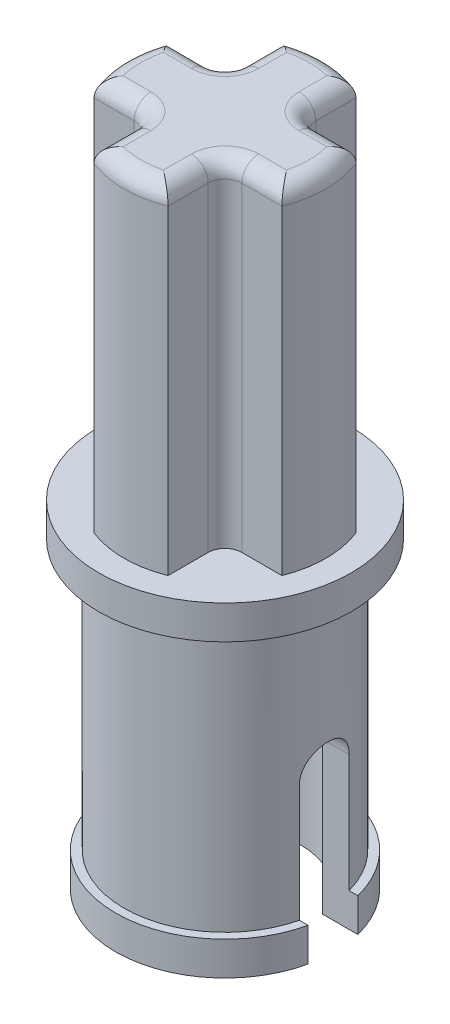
ISO-10303-21;
HEADER;
FILE_DESCRIPTION(('STEP AP214'),'2;1');
FILE_NAME('part.step','',(''),(''),'','','');
FILE_SCHEMA(('AUTOMOTIVE_DESIGN { 1 0 10303 214 1 1 1 1 }'));
ENDSEC;
DATA;
#1=APPLICATION_CONTEXT('core data for automotive mechanical design processes');
#2=APPLICATION_PROTOCOL_DEFINITION('international standard','automotive_design',2000,#1);
#3=PRODUCT_CONTEXT('',#1,'mechanical');
#4=PRODUCT('Part','Part','',(#3));
#5=PRODUCT_RELATED_PRODUCT_CATEGORY('part','',(#4));
#6=PRODUCT_DEFINITION_FORMATION('','',#4);
#7=PRODUCT_DEFINITION_CONTEXT('part definition',#1,'design');
#8=PRODUCT_DEFINITION('design','',#6,#7);
#9=PRODUCT_DEFINITION_SHAPE('','',#8);
#10=(LENGTH_UNIT() NAMED_UNIT(*) SI_UNIT(.MILLI.,.METRE.));
#11=(NAMED_UNIT(*) PLANE_ANGLE_UNIT() SI_UNIT($,.RADIAN.));
#12=(NAMED_UNIT(*) SI_UNIT($,.STERADIAN.) SOLID_ANGLE_UNIT());
#13=UNCERTAINTY_MEASURE_WITH_UNIT(LENGTH_MEASURE(1.E-05),#10,'distance_accuracy_value','');
#14=(GEOMETRIC_REPRESENTATION_CONTEXT(3) GLOBAL_UNCERTAINTY_ASSIGNED_CONTEXT((#13)) GLOBAL_UNIT_ASSIGNED_CONTEXT((#10,
#11,#12)) REPRESENTATION_CONTEXT('',''));
#15=CARTESIAN_POINT('',(0.,0.,0.));
#16=DIRECTION('',(0.,0.,1.));
#17=DIRECTION('',(1.,0.,0.));
#18=AXIS2_PLACEMENT_3D('',#15,#16,#17);
#19=CARTESIAN_POINT('',(0.,8.,0.));
#20=DIRECTION('',(0.,-1.,0.));
#21=DIRECTION('',(0.,0.,-1.));
#22=AXIS2_PLACEMENT_3D('',#19,#20,#21);
#23=CYLINDRICAL_SURFACE('',#22,2.4);
#24=DIRECTION('',(0.,1.,0.));
#25=VECTOR('',#24,1.);
#26=CARTESIAN_POINT('',(0.88,8.,-2.23284571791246));
#27=LINE('',#26,#25);
#28=CARTESIAN_POINT('',(0.88,7.6,-2.23284571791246));
#29=VERTEX_POINT('',#28);
#30=CARTESIAN_POINT('',(0.88,0.,-2.23284571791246));
#31=VERTEX_POINT('',#30);
#32=EDGE_CURVE('E182',#29,#31,#27,.F.);
#33=ORIENTED_EDGE('',*,*,#32,.T.);
#34=CARTESIAN_POINT('',(0.,0.,0.));
#35=DIRECTION('',(0.,-1.,0.));
#36=DIRECTION('',(0.,0.,-1.));
#37=AXIS2_PLACEMENT_3D('',#34,#35,#36);
#38=CIRCLE('',#37,2.4);
#39=CARTESIAN_POINT('',(-0.88,0.,-2.23284571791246));
#40=VERTEX_POINT('',#39);
#41=EDGE_CURVE('E170',#31,#40,#38,.F.);
#42=ORIENTED_EDGE('',*,*,#41,.T.);
#43=DIRECTION('',(0.,1.,0.));
#44=VECTOR('',#43,1.);
#45=CARTESIAN_POINT('',(-0.88,8.,-2.23284571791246));
#46=LINE('',#45,#44);
#47=CARTESIAN_POINT('',(-0.88,7.6,-2.23284571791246));
#48=VERTEX_POINT('',#47);
#49=EDGE_CURVE('E179',#40,#48,#46,.T.);
#50=ORIENTED_EDGE('',*,*,#49,.T.);
#51=CARTESIAN_POINT('',(0.,7.6,0.));
#52=DIRECTION('',(0.,-1.,0.));
#53=DIRECTION('',(0.,0.,-1.));
#54=AXIS2_PLACEMENT_3D('',#51,#52,#53);
#55=CIRCLE('',#54,2.4);
#56=EDGE_CURVE('E185',#48,#29,#55,.T.);
#57=ORIENTED_EDGE('',*,*,#56,.T.);
#58=EDGE_LOOP('',(#33,#42,#50,#57));
#59=FACE_BOUND('',#58,.T.);
#60=ADVANCED_FACE('F16',(#59),#23,.T.);
#61=CARTESIAN_POINT('',(-0.88,8.,-2.23284571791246));
#62=DIRECTION('',(1.,0.,0.));
#63=DIRECTION('',(0.,0.,-1.));
#64=AXIS2_PLACEMENT_3D('',#61,#62,#63);
#65=PLANE('',#64);
#66=DIRECTION('',(0.,0.,-1.));
#67=VECTOR('',#66,1.);
#68=CARTESIAN_POINT('',(-0.88,7.6,0.));
#69=LINE('',#68,#67);
#70=CARTESIAN_POINT('',(-0.88,7.6,-1.28));
#71=VERTEX_POINT('',#70);
#72=EDGE_CURVE('E197',#48,#71,#69,.F.);
#73=ORIENTED_EDGE('',*,*,#72,.F.);
#74=ORIENTED_EDGE('',*,*,#49,.F.);
#75=DIRECTION('',(0.,0.,-1.));
#76=VECTOR('',#75,1.);
#77=CARTESIAN_POINT('',(-0.88,0.,-2.23284571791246));
#78=LINE('',#77,#76);
#79=CARTESIAN_POINT('',(-0.88,0.,-1.28));
#80=VERTEX_POINT('',#79);
#81=EDGE_CURVE('E184',#80,#40,#78,.T.);
#82=ORIENTED_EDGE('',*,*,#81,.F.);
#83=DIRECTION('',(0.,-1.,0.));
#84=VECTOR('',#83,1.);
#85=CARTESIAN_POINT('',(-0.88,8.,-1.28));
#86=LINE('',#85,#84);
#87=EDGE_CURVE('E944',#80,#71,#86,.F.);
#88=ORIENTED_EDGE('',*,*,#87,.T.);
#89=EDGE_LOOP('',(#73,#74,#82,#88));
#90=FACE_BOUND('',#89,.T.);
#91=ADVANCED_FACE('F195',(#90),#65,.F.);
#92=CARTESIAN_POINT('',(0.88,8.,-1.28));
#93=DIRECTION('',(-1.,0.,0.));
#94=DIRECTION('',(0.,0.,1.));
#95=AXIS2_PLACEMENT_3D('',#92,#93,#94);
#96=PLANE('',#95);
#97=DIRECTION('',(0.,0.,1.));
#98=VECTOR('',#97,1.);
#99=CARTESIAN_POINT('',(0.88,7.6,0.));
#100=LINE('',#99,#98);
#101=CARTESIAN_POINT('',(0.88,7.6,-1.28));
#102=VERTEX_POINT('',#101);
#103=EDGE_CURVE('E877',#102,#29,#100,.F.);
#104=ORIENTED_EDGE('',*,*,#103,.F.);
#105=DIRECTION('',(0.,-1.,0.));
#106=VECTOR('',#105,1.);
#107=CARTESIAN_POINT('',(0.88,8.,-1.28));
#108=LINE('',#107,#106);
#109=CARTESIAN_POINT('',(0.88,0.,-1.28));
#110=VERTEX_POINT('',#109);
#111=EDGE_CURVE('E671',#102,#110,#108,.T.);
#112=ORIENTED_EDGE('',*,*,#111,.T.);
#113=DIRECTION('',(0.,0.,1.));
#114=VECTOR('',#113,1.);
#115=CARTESIAN_POINT('',(0.88,0.,-1.28));
#116=LINE('',#115,#114);
#117=EDGE_CURVE('E199',#31,#110,#116,.T.);
#118=ORIENTED_EDGE('',*,*,#117,.F.);
#119=ORIENTED_EDGE('',*,*,#32,.F.);
#120=EDGE_LOOP('',(#104,#112,#118,#119));
#121=FACE_BOUND('',#120,.T.);
#122=ADVANCED_FACE('F1383',(#121),#96,.F.);
#123=CARTESIAN_POINT('',(-1.28,7.6,1.28));
#124=DIRECTION('',(0.,1.,0.));
#125=DIRECTION('',(0.,0.,1.));
#126=AXIS2_PLACEMENT_3D('',#123,#124,#125);
#127=TOROIDAL_SURFACE('',#126,0.8,0.4);
#128=CARTESIAN_POINT('',(-0.48,7.6,1.28));
#129=DIRECTION('',(0.,0.,-1.));
#130=DIRECTION('',(-1.,0.,0.));
#131=AXIS2_PLACEMENT_3D('',#128,#129,#130);
#132=CIRCLE('',#131,0.4);
#133=CARTESIAN_POINT('',(-0.48,8.,1.28));
#134=VERTEX_POINT('',#133);
#135=CARTESIAN_POINT('',(-0.88,7.6,1.28));
#136=VERTEX_POINT('',#135);
#137=EDGE_CURVE('E748',#134,#136,#132,.F.);
#138=ORIENTED_EDGE('',*,*,#137,.F.);
#139=CARTESIAN_POINT('',(-1.28,8.,1.28));
#140=DIRECTION('',(0.,1.,0.));
#141=DIRECTION('',(1.,0.,0.));
#142=AXIS2_PLACEMENT_3D('',#139,#140,#141);
#143=CIRCLE('',#142,0.8);
#144=CARTESIAN_POINT('',(-1.28,8.,0.48));
#145=VERTEX_POINT('',#144);
#146=EDGE_CURVE('E639',#145,#134,#143,.F.);
#147=ORIENTED_EDGE('',*,*,#146,.F.);
#148=CARTESIAN_POINT('',(-1.28,7.6,0.48));
#149=DIRECTION('',(-1.,0.,0.));
#150=DIRECTION('',(0.,0.,1.));
#151=AXIS2_PLACEMENT_3D('',#148,#149,#150);
#152=CIRCLE('',#151,0.4);
#153=CARTESIAN_POINT('',(-1.28,7.6,0.88));
#154=VERTEX_POINT('',#153);
#155=EDGE_CURVE('E723',#154,#145,#152,.T.);
#156=ORIENTED_EDGE('',*,*,#155,.F.);
#157=CARTESIAN_POINT('',(-1.28,7.6,1.28));
#158=DIRECTION('',(0.,-1.,0.));
#159=DIRECTION('',(0.,0.,-1.));
#160=AXIS2_PLACEMENT_3D('',#157,#158,#159);
#161=CIRCLE('',#160,0.4);
#162=EDGE_CURVE('E731',#154,#136,#161,.T.);
#163=ORIENTED_EDGE('',*,*,#162,.T.);
#164=EDGE_LOOP('',(#138,#147,#156,#163));
#165=FACE_BOUND('',#164,.T.);
#166=ADVANCED_FACE('F898',(#165),#127,.T.);
#167=CARTESIAN_POINT('',(1.28,7.6,-1.28));
#168=DIRECTION('',(0.,1.,0.));
#169=DIRECTION('',(0.,0.,1.));
#170=AXIS2_PLACEMENT_3D('',#167,#168,#169);
#171=TOROIDAL_SURFACE('',#170,0.8,0.4);
#172=CARTESIAN_POINT('',(1.28,7.6,-0.48));
#173=DIRECTION('',(1.,0.,0.));
#174=DIRECTION('',(0.,0.,-1.));
#175=AXIS2_PLACEMENT_3D('',#172,#173,#174);
#176=CIRCLE('',#175,0.4);
#177=CARTESIAN_POINT('',(1.28,7.6,-0.88));
#178=VERTEX_POINT('',#177);
#179=CARTESIAN_POINT('',(1.28,8.,-0.48));
#180=VERTEX_POINT('',#179);
#181=EDGE_CURVE('E663',#178,#180,#176,.T.);
#182=ORIENTED_EDGE('',*,*,#181,.F.);
#183=CARTESIAN_POINT('',(1.28,7.6,-1.28));
#184=DIRECTION('',(0.,-1.,0.));
#185=DIRECTION('',(0.,0.,-1.));
#186=AXIS2_PLACEMENT_3D('',#183,#184,#185);
#187=CIRCLE('',#186,0.4);
#188=EDGE_CURVE('E674',#178,#102,#187,.T.);
#189=ORIENTED_EDGE('',*,*,#188,.T.);
#190=CARTESIAN_POINT('',(0.48,7.6,-1.28));
#191=DIRECTION('',(0.,0.,1.));
#192=DIRECTION('',(1.,0.,0.));
#193=AXIS2_PLACEMENT_3D('',#190,#191,#192);
#194=CIRCLE('',#193,0.4);
#195=CARTESIAN_POINT('',(0.48,8.,-1.28));
#196=VERTEX_POINT('',#195);
#197=EDGE_CURVE('E207',#196,#102,#194,.F.);
#198=ORIENTED_EDGE('',*,*,#197,.F.);
#199=CARTESIAN_POINT('',(1.28,8.,-1.28));
#200=DIRECTION('',(0.,1.,0.));
#201=DIRECTION('',(-1.,0.,0.));
#202=AXIS2_PLACEMENT_3D('',#199,#200,#201);
#203=CIRCLE('',#202,0.8);
#204=EDGE_CURVE('E625',#180,#196,#203,.F.);
#205=ORIENTED_EDGE('',*,*,#204,.F.);
#206=EDGE_LOOP('',(#182,#189,#198,#205));
#207=FACE_BOUND('',#206,.T.);
#208=ADVANCED_FACE('F894',(#207),#171,.T.);
#209=CARTESIAN_POINT('',(0.48,7.6,0.));
#210=DIRECTION('',(0.,0.,1.));
#211=DIRECTION('',(1.,0.,0.));
#212=AXIS2_PLACEMENT_3D('',#209,#210,#211);
#213=CYLINDRICAL_SURFACE('',#212,0.4);
#214=CARTESIAN_POINT('',(0.48,8.,-1.94154577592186));
#215=CARTESIAN_POINT('',(0.486567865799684,8.00000003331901,-1.9466844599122));
#216=CARTESIAN_POINT('',(0.493142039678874,7.99983838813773,-1.95181538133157));
#217=CARTESIAN_POINT('',(0.506196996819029,7.99919274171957,-1.9619751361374));
#218=CARTESIAN_POINT('',(0.512677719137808,7.99871355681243,-1.96700435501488));
#219=CARTESIAN_POINT('',(0.525535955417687,7.99744377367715,-1.97695050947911));
#220=CARTESIAN_POINT('',(0.531913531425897,7.99665805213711,-1.98186798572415));
#221=CARTESIAN_POINT('',(0.544555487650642,7.99478673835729,-1.9915815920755));
#222=CARTESIAN_POINT('',(0.55082006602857,7.99370607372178,-1.99637841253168));
#223=CARTESIAN_POINT('',(0.563226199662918,7.99125687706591,-2.00584270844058));
#224=CARTESIAN_POINT('',(0.569368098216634,7.98989331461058,-2.0105110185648));
#225=CARTESIAN_POINT('',(0.581519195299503,7.98689072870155,-2.01971134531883));
#226=CARTESIAN_POINT('',(0.587528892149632,7.98525670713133,-2.02424433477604));
#227=CARTESIAN_POINT('',(0.599406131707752,7.98172593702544,-2.03316808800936));
#228=CARTESIAN_POINT('',(0.605274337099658,7.97983421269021,-2.03755995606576));
#229=CARTESIAN_POINT('',(0.616859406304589,7.97580103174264,-2.04619651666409));
#230=CARTESIAN_POINT('',(0.622577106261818,7.97366461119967,-2.05044243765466));
#231=CARTESIAN_POINT('',(0.63385228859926,7.96915522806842,-2.05878309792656));
#232=CARTESIAN_POINT('',(0.63941078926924,7.96678730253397,-2.06287918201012));
#233=CARTESIAN_POINT('',(0.650359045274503,7.96182823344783,-2.07091706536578));
#234=CARTESIAN_POINT('',(0.655750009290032,7.95924211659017,-2.07486031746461));
#235=CARTESIAN_POINT('',(0.666355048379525,7.95386006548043,-2.08259029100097));
#236=CARTESIAN_POINT('',(0.671570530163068,7.95106913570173,-2.08637856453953));
#237=CARTESIAN_POINT('',(0.681816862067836,7.94529087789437,-2.09379715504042));
#238=CARTESIAN_POINT('',(0.686849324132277,7.94230851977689,-2.0974291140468));
#239=CARTESIAN_POINT('',(0.696722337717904,7.93616080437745,-2.10453439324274));
#240=CARTESIAN_POINT('',(0.701564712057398,7.93300036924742,-2.1080094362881));
#241=CARTESIAN_POINT('',(0.71105060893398,7.92650978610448,-2.11480100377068));
#242=CARTESIAN_POINT('',(0.715696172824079,7.92318449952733,-2.11811932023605));
#243=CARTESIAN_POINT('',(0.724782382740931,7.91637750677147,-2.12459792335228));
#244=CARTESIAN_POINT('',(0.72922528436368,7.91290058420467,-2.12776006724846));
#245=CARTESIAN_POINT('',(0.737899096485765,7.90580298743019,-2.13392852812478));
#246=CARTESIAN_POINT('',(0.742132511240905,7.90218701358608,-2.13693673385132));
#247=CARTESIAN_POINT('',(0.751569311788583,7.89377014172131,-2.14363612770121));
#248=CARTESIAN_POINT('',(0.756736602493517,7.88890679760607,-2.14730002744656));
#249=CARTESIAN_POINT('',(0.766793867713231,7.87891570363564,-2.15441527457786));
#250=CARTESIAN_POINT('',(0.771686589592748,7.87379225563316,-2.15786877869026));
#251=CARTESIAN_POINT('',(0.781182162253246,7.8632960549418,-2.16455803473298));
#252=CARTESIAN_POINT('',(0.785787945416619,7.85792738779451,-2.16779602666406));
#253=CARTESIAN_POINT('',(0.794699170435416,7.84695733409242,-2.17404813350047));
#254=CARTESIAN_POINT('',(0.799007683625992,7.84135976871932,-2.1770645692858));
#255=CARTESIAN_POINT('',(0.807314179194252,7.82994885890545,-2.18286848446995));
#256=CARTESIAN_POINT('',(0.811315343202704,7.82413903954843,-2.18565833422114));
#257=CARTESIAN_POINT('',(0.818997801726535,7.81232107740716,-2.1910045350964));
#258=CARTESIAN_POINT('',(0.822682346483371,7.80631613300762,-2.19356327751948));
#259=CARTESIAN_POINT('',(0.829722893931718,7.79412602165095,-2.19844331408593));
#260=CARTESIAN_POINT('',(0.833082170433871,7.7879436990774,-2.20076698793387));
#261=CARTESIAN_POINT('',(0.83946464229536,7.77541657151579,-2.20517375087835));
#262=CARTESIAN_POINT('',(0.842491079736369,7.76907424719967,-2.20725917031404));
#263=CARTESIAN_POINT('',(0.846783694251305,7.75943011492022,-2.21021186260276));
#264=CARTESIAN_POINT('',(0.848168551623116,7.75620623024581,-2.21116353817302));
#265=CARTESIAN_POINT('',(0.850852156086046,7.74972518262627,-2.21300608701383));
#266=CARTESIAN_POINT('',(0.85215128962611,7.74646825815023,-2.21389723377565));
#267=CARTESIAN_POINT('',(0.854662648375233,7.73992360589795,-2.21561842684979));
#268=CARTESIAN_POINT('',(0.855875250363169,7.73663609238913,-2.21644873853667));
#269=CARTESIAN_POINT('',(0.858212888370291,7.73003259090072,-2.21804805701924));
#270=CARTESIAN_POINT('',(0.859338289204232,7.7267167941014,-2.21881731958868));
#271=CARTESIAN_POINT('',(0.861500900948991,7.72005910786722,-2.22029435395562));
#272=CARTESIAN_POINT('',(0.862538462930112,7.71671738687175,-2.22100237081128));
#273=CARTESIAN_POINT('',(0.86452483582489,7.71001023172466,-2.22235676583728));
#274=CARTESIAN_POINT('',(0.865473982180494,7.70664494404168,-2.22300337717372));
#275=CARTESIAN_POINT('',(0.867283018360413,7.69989304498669,-2.22423484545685));
#276=CARTESIAN_POINT('',(0.868143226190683,7.69650655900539,-2.22481992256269));
#277=CARTESIAN_POINT('',(0.869773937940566,7.68971465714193,-2.22592823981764));
#278=CARTESIAN_POINT('',(0.870544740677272,7.6863093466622,-2.22645168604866));
#279=CARTESIAN_POINT('',(0.871996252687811,7.67948219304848,-2.22743669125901));
#280=CARTESIAN_POINT('',(0.872677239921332,7.67606043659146,-2.22789844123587));
#281=CARTESIAN_POINT('',(0.873948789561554,7.6692027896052,-2.22876003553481));
#282=CARTESIAN_POINT('',(0.874539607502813,7.66576696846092,-2.22916005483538));
#283=CARTESIAN_POINT('',(0.875630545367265,7.65888359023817,-2.22989820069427));
#284=CARTESIAN_POINT('',(0.876130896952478,7.65543608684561,-2.23023648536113));
#285=CARTESIAN_POINT('',(0.87704068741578,7.64853174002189,-2.23085120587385));
#286=CARTESIAN_POINT('',(0.877450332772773,7.64507493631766,-2.23112778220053));
#287=CARTESIAN_POINT('',(0.878178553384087,7.63815438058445,-2.23161915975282));
#288=CARTESIAN_POINT('',(0.87849730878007,7.63469065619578,-2.23183408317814));
#289=CARTESIAN_POINT('',(0.87904365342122,7.62775864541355,-2.23220226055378));
#290=CARTESIAN_POINT('',(0.879271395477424,7.62429037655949,-2.23235561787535));
#291=CARTESIAN_POINT('',(0.879635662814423,7.61735165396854,-2.23260079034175));
#292=CARTESIAN_POINT('',(0.879772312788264,7.61388120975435,-2.2326926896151));
#293=CARTESIAN_POINT('',(0.879954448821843,7.60694051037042,-2.23281513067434));
#294=CARTESIAN_POINT('',(0.880000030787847,7.60347025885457,-2.23284573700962));
#295=CARTESIAN_POINT('',(0.88,7.6,-2.23284571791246));
#296=B_SPLINE_CURVE_WITH_KNOTS('',3,(#214,#215,#216,#217,#218,#219,#220,#221,#222,#223,#224,
#225,#226,#227,#228,#229,#230,#231,#232,#233,#234,#235,#236,#237,#238,#239,#240,#241,#242,#243,
#244,#245,#246,#247,#248,#249,#250,#251,#252,#253,#254,#255,#256,#257,#258,#259,#260,#261,#262,
#263,#264,#265,#266,#267,#268,#269,#270,#271,#272,#273,#274,#275,#276,#277,#278,#279,#280,#281,
#282,#283,#284,#285,#286,#287,#288,#289,#290,#291,#292,#293,#294,#295),.UNSPECIFIED.,.F.,.F.,(4,
2,2,2,2,2,2,2,2,2,2,2,2,2,2,2,2,2,2,2,2,2,2,2,2,2,2,2,2,2,2,2,2,2,2,2,2,2,2,2,4),(0.,
0.0250164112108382,0.0496618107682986,0.0739301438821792,0.097815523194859,0.121312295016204,
0.144415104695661,0.167118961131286,0.189419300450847,0.211312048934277,0.232793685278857,
0.25386130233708,0.27451266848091,0.294746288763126,0.314561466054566,0.333958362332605,
0.3529380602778,0.376884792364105,0.400517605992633,0.423844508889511,0.446875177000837,
0.469620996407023,0.492095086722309,0.51431230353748,0.53628921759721,0.547194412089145,
0.558046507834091,0.568848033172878,0.57960161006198,0.590309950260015,0.600975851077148,
0.611602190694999,0.622191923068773,0.63274807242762,0.643273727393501,0.653772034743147,
0.664246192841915,0.674699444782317,0.685135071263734,0.695556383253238,0.705966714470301),.UNSPECIFIED.);
#297=CARTESIAN_POINT('',(0.48,8.,-1.94154577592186));
#298=VERTEX_POINT('',#297);
#299=EDGE_CURVE('E873',#298,#29,#296,.T.);
#300=ORIENTED_EDGE('',*,*,#299,.F.);
#301=DIRECTION('',(0.,0.,1.));
#302=VECTOR('',#301,1.);
#303=CARTESIAN_POINT('',(0.48,8.,0.));
#304=LINE('',#303,#302);
#305=EDGE_CURVE('E622',#196,#298,#304,.F.);
#306=ORIENTED_EDGE('',*,*,#305,.F.);
#307=ORIENTED_EDGE('',*,*,#197,.T.);
#308=ORIENTED_EDGE('',*,*,#103,.T.);
#309=EDGE_LOOP('',(#300,#306,#307,#308));
#310=FACE_BOUND('',#309,.T.);
#311=ADVANCED_FACE('F838',(#310),#213,.T.);
#312=CARTESIAN_POINT('',(0.,7.6,0.));
#313=DIRECTION('',(0.,1.,0.));
#314=DIRECTION('',(0.,0.,1.));
#315=AXIS2_PLACEMENT_3D('',#312,#313,#314);
#316=TOROIDAL_SURFACE('',#315,2.,0.4);
#317=CARTESIAN_POINT('',(-0.879999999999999,7.6,-2.23284571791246));
#318=CARTESIAN_POINT('',(-0.880000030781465,7.60346963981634,-2.23284573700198));
#319=CARTESIAN_POINT('',(-0.879954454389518,7.60693927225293,-2.23281514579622));
#320=CARTESIAN_POINT('',(-0.879772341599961,7.61387877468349,-2.23269276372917));
#321=CARTESIAN_POINT('',(-0.879635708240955,7.61734864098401,-2.2326009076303));
#322=CARTESIAN_POINT('',(-0.879271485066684,7.62428625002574,-2.23235584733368));
#323=CARTESIAN_POINT('',(-0.879043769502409,7.62775398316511,-2.23220255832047));
#324=CARTESIAN_POINT('',(-0.878497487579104,7.63468496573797,-2.23183454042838));
#325=CARTESIAN_POINT('',(-0.878178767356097,7.63814819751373,-2.23161970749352));
#326=CARTESIAN_POINT('',(-0.877450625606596,7.64506781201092,-2.23112853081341));
#327=CARTESIAN_POINT('',(-0.877041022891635,7.64852416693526,-2.23085206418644));
#328=CARTESIAN_POINT('',(-0.876131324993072,7.65542766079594,-2.23023757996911));
#329=CARTESIAN_POINT('',(-0.875631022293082,7.65887475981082,-2.22989942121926));
#330=CARTESIAN_POINT('',(-0.874540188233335,7.66575737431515,-2.22916154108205));
#331=CARTESIAN_POINT('',(-0.873949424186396,7.66919283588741,-2.22876166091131));
#332=CARTESIAN_POINT('',(-0.872677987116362,7.67604980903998,-2.22790035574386));
#333=CARTESIAN_POINT('',(-0.871997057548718,7.6794712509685,-2.22743875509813));
#334=CARTESIAN_POINT('',(-0.870545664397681,7.68629782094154,-2.22645405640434));
#335=CARTESIAN_POINT('',(-0.869774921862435,7.68970286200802,-2.22593076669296));
#336=CARTESIAN_POINT('',(-0.868144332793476,7.69649427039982,-2.22482276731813));
#337=CARTESIAN_POINT('',(-0.86728418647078,7.69988053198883,-2.22423785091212));
#338=CARTESIAN_POINT('',(-0.865475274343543,7.70663202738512,-2.22300670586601));
#339=CARTESIAN_POINT('',(-0.864526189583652,7.70999713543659,-2.22236025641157));
#340=CARTESIAN_POINT('',(-0.862539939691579,7.71670397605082,-2.22100618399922));
#341=CARTESIAN_POINT('',(-0.861502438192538,7.72004556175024,-2.22029832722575));
#342=CARTESIAN_POINT('',(-0.859339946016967,7.72670302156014,-2.21882160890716));
#343=CARTESIAN_POINT('',(-0.858214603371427,7.73001872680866,-2.21805250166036));
#344=CARTESIAN_POINT('',(-0.855877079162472,7.73662208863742,-2.21645348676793));
#345=CARTESIAN_POINT('',(-0.854664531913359,7.73990955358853,-2.21562332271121));
#346=CARTESIAN_POINT('',(-0.852153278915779,7.74645415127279,-2.21390241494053));
#347=CARTESIAN_POINT('',(-0.850854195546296,7.74971106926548,-2.21301140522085));
#348=CARTESIAN_POINT('',(-0.848170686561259,7.75619214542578,-2.21116911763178));
#349=CARTESIAN_POINT('',(-0.846785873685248,7.75941606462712,-2.21021756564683));
#350=CARTESIAN_POINT('',(-0.842493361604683,7.7690604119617,-2.2072652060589));
#351=CARTESIAN_POINT('',(-0.839466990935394,7.7754029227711,-2.20517998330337));
#352=CARTESIAN_POINT('',(-0.833084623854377,7.78793057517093,-2.20077353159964));
#353=CARTESIAN_POINT('',(-0.829725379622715,7.79411323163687,-2.1984499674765));
#354=CARTESIAN_POINT('',(-0.822684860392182,7.80630414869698,-2.19357004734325));
#355=CARTESIAN_POINT('',(-0.819000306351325,7.81230956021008,-2.19101130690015));
#356=CARTESIAN_POINT('',(-0.811317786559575,7.82412857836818,-2.18566498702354));
#357=CARTESIAN_POINT('',(-0.807316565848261,7.8299389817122,-2.18287501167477));
#358=CARTESIAN_POINT('',(-0.799009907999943,7.84135116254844,-2.17707070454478));
#359=CARTESIAN_POINT('',(-0.794701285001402,7.84694940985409,-2.1740539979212));
#360=CARTESIAN_POINT('',(-0.785789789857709,7.85792091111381,-2.16780118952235));
#361=CARTESIAN_POINT('',(-0.781183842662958,7.86329033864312,-2.16456276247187));
#362=CARTESIAN_POINT('',(-0.77168787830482,7.87378811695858,-2.15787246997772));
#363=CARTESIAN_POINT('',(-0.766794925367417,7.87891237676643,-2.15441836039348));
#364=CARTESIAN_POINT('',(-0.756737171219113,7.88890514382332,-2.14730168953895));
#365=CARTESIAN_POINT('',(-0.751569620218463,7.8937693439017,-2.14363696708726));
#366=CARTESIAN_POINT('',(-0.742134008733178,7.90218609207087,-2.13693730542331));
#367=CARTESIAN_POINT('',(-0.737902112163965,7.9058011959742,-2.13392969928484));
#368=CARTESIAN_POINT('',(-0.729231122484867,7.91289725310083,-2.12776245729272));
#369=CARTESIAN_POINT('',(-0.724789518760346,7.91637349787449,-2.1246009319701));
#370=CARTESIAN_POINT('',(-0.715705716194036,7.92317933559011,-2.11812354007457));
#371=CARTESIAN_POINT('',(-0.711061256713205,7.9265041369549,-2.11480581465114));
#372=CARTESIAN_POINT('',(-0.701577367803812,7.9329939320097,-2.10801539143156));
#373=CARTESIAN_POINT('',(-0.696735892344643,7.9361540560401,-2.10454089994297));
#374=CARTESIAN_POINT('',(-0.686864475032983,7.94230131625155,-2.09743666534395));
#375=CARTESIAN_POINT('',(-0.681832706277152,7.94528352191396,-2.09380519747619));
#376=CARTESIAN_POINT('',(-0.671587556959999,7.95106162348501,-2.08638751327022));
#377=CARTESIAN_POINT('',(-0.666372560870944,7.95385254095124,-2.08259965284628));
#378=CARTESIAN_POINT('',(-0.655768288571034,7.95923469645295,-2.07487041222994));
#379=CARTESIAN_POINT('',(-0.65037760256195,7.96182092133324,-2.07092747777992));
#380=CARTESIAN_POINT('',(-0.63942969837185,7.96678031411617,-2.06289012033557));
#381=CARTESIAN_POINT('',(-0.633871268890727,7.96914844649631,-2.05879424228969));
#382=CARTESIAN_POINT('',(-0.622596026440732,7.97365832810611,-2.05045386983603));
#383=CARTESIAN_POINT('',(-0.616878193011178,7.97579503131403,-2.04620802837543));
#384=CARTESIAN_POINT('',(-0.60529265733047,7.97982883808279,-2.03757148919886));
#385=CARTESIAN_POINT('',(-0.599424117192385,7.98172089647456,-2.0331795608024));
#386=CARTESIAN_POINT('',(-0.587546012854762,7.98525236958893,-2.02425553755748));
#387=CARTESIAN_POINT('',(-0.581535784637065,7.98688675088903,-2.01972233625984));
#388=CARTESIAN_POINT('',(-0.569383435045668,7.98989006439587,-2.01052142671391));
#389=CARTESIAN_POINT('',(-0.563240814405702,7.99125398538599,-2.00585274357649));
#390=CARTESIAN_POINT('',(-0.550833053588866,7.99370387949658,-1.99638753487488));
#391=CARTESIAN_POINT('',(-0.544567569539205,7.99478487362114,-1.99159017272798));
#392=CARTESIAN_POINT('',(-0.531923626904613,7.99665679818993,-1.98187531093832));
#393=CARTESIAN_POINT('',(-0.525544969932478,7.99744279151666,-1.97695711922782));
#394=CARTESIAN_POINT('',(-0.512684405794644,7.99871304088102,-1.96700935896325));
#395=CARTESIAN_POINT('',(-0.506202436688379,7.99919241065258,-1.96197924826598));
#396=CARTESIAN_POINT('',(-0.493144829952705,7.99983831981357,-1.95181753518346));
#397=CARTESIAN_POINT('',(-0.486569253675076,8.00000003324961,-1.9466855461));
#398=CARTESIAN_POINT('',(-0.48,8.,-1.94154577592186));
#399=B_SPLINE_CURVE_WITH_KNOTS('',3,(#317,#318,#319,#320,#321,#322,#323,#324,#325,#326,#327,
#328,#329,#330,#331,#332,#333,#334,#335,#336,#337,#338,#339,#340,#341,#342,#343,#344,#345,#346,
#347,#348,#349,#350,#351,#352,#353,#354,#355,#356,#357,#358,#359,#360,#361,#362,#363,#364,#365,
#366,#367,#368,#369,#370,#371,#372,#373,#374,#375,#376,#377,#378,#379,#380,#381,#382,#383,#384,
#385,#386,#387,#388,#389,#390,#391,#392,#393,#394,#395,#396,#397,#398),.UNSPECIFIED.,.F.,.F.,(4,
2,2,2,2,2,2,2,2,2,2,2,2,2,2,2,2,2,2,2,2,2,2,2,2,2,2,2,2,2,2,2,2,2,2,2,2,2,2,2,4),(0.,
0.0104084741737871,0.0208280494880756,0.0312620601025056,0.0417138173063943,0.0521866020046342,
0.0626836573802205,0.0732081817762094,0.0837633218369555,0.0943521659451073,0.104977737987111,
0.115642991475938,0.126350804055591,0.137103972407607,0.147905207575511,0.158757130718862,
0.169662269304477,0.191639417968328,0.213857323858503,0.236332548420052,0.259079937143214,
0.282112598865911,0.305441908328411,0.329077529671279,0.353027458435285,0.372001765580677,
0.391393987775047,0.411205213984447,0.431435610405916,0.452084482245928,0.473150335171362,
0.494630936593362,0.516523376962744,0.53882413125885,0.561529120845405,0.584633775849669,
0.608133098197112,0.632021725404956,0.656293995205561,0.680944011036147,0.705965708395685),.UNSPECIFIED.);
#400=CARTESIAN_POINT('',(-0.48,8.,-1.94154577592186));
#401=VERTEX_POINT('',#400);
#402=EDGE_CURVE('E818',#401,#48,#399,.F.);
#403=ORIENTED_EDGE('',*,*,#402,.F.);
#404=CARTESIAN_POINT('',(0.,8.,0.));
#405=DIRECTION('',(0.,-1.,0.));
#406=DIRECTION('',(-0.239999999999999,0.,-0.970772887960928));
#407=AXIS2_PLACEMENT_3D('',#404,#405,#406);
#408=CIRCLE('',#407,2.);
#409=EDGE_CURVE('E619',#298,#401,#408,.F.);
#410=ORIENTED_EDGE('',*,*,#409,.F.);
#411=ORIENTED_EDGE('',*,*,#299,.T.);
#412=ORIENTED_EDGE('',*,*,#56,.F.);
#413=EDGE_LOOP('',(#403,#410,#411,#412));
#414=FACE_BOUND('',#413,.T.);
#415=ADVANCED_FACE('F834',(#414),#316,.T.);
#416=CARTESIAN_POINT('',(-0.48,7.6,0.));
#417=DIRECTION('',(0.,0.,-1.));
#418=DIRECTION('',(-1.,0.,0.));
#419=AXIS2_PLACEMENT_3D('',#416,#417,#418);
#420=CYLINDRICAL_SURFACE('',#419,0.4);
#421=CARTESIAN_POINT('',(-0.48,7.6,-1.28000000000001));
#422=DIRECTION('',(0.,0.,-1.));
#423=DIRECTION('',(1.,0.,0.));
#424=AXIS2_PLACEMENT_3D('',#421,#422,#423);
#425=CIRCLE('',#424,0.4);
#426=CARTESIAN_POINT('',(-0.48,8.,-1.28000000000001));
#427=VERTEX_POINT('',#426);
#428=EDGE_CURVE('E780',#427,#71,#425,.F.);
#429=ORIENTED_EDGE('',*,*,#428,.F.);
#430=DIRECTION('',(0.,0.,1.));
#431=VECTOR('',#430,1.);
#432=CARTESIAN_POINT('',(-0.48,8.,0.));
#433=LINE('',#432,#431);
#434=EDGE_CURVE('E616',#401,#427,#433,.T.);
#435=ORIENTED_EDGE('',*,*,#434,.F.);
#436=ORIENTED_EDGE('',*,*,#402,.T.);
#437=ORIENTED_EDGE('',*,*,#72,.T.);
#438=EDGE_LOOP('',(#429,#435,#436,#437));
#439=FACE_BOUND('',#438,.T.);
#440=ADVANCED_FACE('F798',(#439),#420,.T.);
#441=CARTESIAN_POINT('',(-1.28,7.6,-1.28));
#442=DIRECTION('',(0.,1.,0.));
#443=DIRECTION('',(0.,0.,1.));
#444=AXIS2_PLACEMENT_3D('',#441,#442,#443);
#445=TOROIDAL_SURFACE('',#444,0.8,0.4);
#446=CARTESIAN_POINT('',(-1.28,7.6,-0.48));
#447=DIRECTION('',(1.,0.,0.));
#448=DIRECTION('',(0.,0.,-1.));
#449=AXIS2_PLACEMENT_3D('',#446,#447,#448);
#450=CIRCLE('',#449,0.4);
#451=CARTESIAN_POINT('',(-1.28,8.,-0.48));
#452=VERTEX_POINT('',#451);
#453=CARTESIAN_POINT('',(-1.28,7.6,-0.88));
#454=VERTEX_POINT('',#453);
#455=EDGE_CURVE('E694',#452,#454,#450,.F.);
#456=ORIENTED_EDGE('',*,*,#455,.F.);
#457=CARTESIAN_POINT('',(-1.28,8.,-1.28));
#458=DIRECTION('',(0.,1.,0.));
#459=DIRECTION('',(0.,0.,1.));
#460=AXIS2_PLACEMENT_3D('',#457,#458,#459);
#461=CIRCLE('',#460,0.8);
#462=EDGE_CURVE('E613',#427,#452,#461,.F.);
#463=ORIENTED_EDGE('',*,*,#462,.F.);
#464=ORIENTED_EDGE('',*,*,#428,.T.);
#465=CARTESIAN_POINT('',(-1.28,7.6,-1.28));
#466=DIRECTION('',(0.,-1.,0.));
#467=DIRECTION('',(0.,0.,-1.));
#468=AXIS2_PLACEMENT_3D('',#465,#466,#467);
#469=CIRCLE('',#468,0.4);
#470=EDGE_CURVE('E945',#71,#454,#469,.T.);
#471=ORIENTED_EDGE('',*,*,#470,.T.);
#472=EDGE_LOOP('',(#456,#463,#464,#471));
#473=FACE_BOUND('',#472,.T.);
#474=ADVANCED_FACE('F794',(#473),#445,.T.);
#475=CARTESIAN_POINT('',(1.28,7.6,1.28));
#476=DIRECTION('',(0.,1.,0.));
#477=DIRECTION('',(0.,0.,1.));
#478=AXIS2_PLACEMENT_3D('',#475,#476,#477);
#479=TOROIDAL_SURFACE('',#478,0.8,0.4);
#480=CARTESIAN_POINT('',(0.48,7.6,1.28));
#481=DIRECTION('',(0.,0.,1.));
#482=DIRECTION('',(1.,0.,0.));
#483=AXIS2_PLACEMENT_3D('',#480,#481,#482);
#484=CIRCLE('',#483,0.4);
#485=CARTESIAN_POINT('',(0.88,7.6,1.28));
#486=VERTEX_POINT('',#485);
#487=CARTESIAN_POINT('',(0.48,8.,1.28000000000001));
#488=VERTEX_POINT('',#487);
#489=EDGE_CURVE('E772',#486,#488,#484,.T.);
#490=ORIENTED_EDGE('',*,*,#489,.F.);
#491=CARTESIAN_POINT('',(1.28,7.6,1.28));
#492=DIRECTION('',(0.,-1.,0.));
#493=DIRECTION('',(0.,0.,-1.));
#494=AXIS2_PLACEMENT_3D('',#491,#492,#493);
#495=CIRCLE('',#494,0.4);
#496=CARTESIAN_POINT('',(1.28,7.6,0.88));
#497=VERTEX_POINT('',#496);
#498=EDGE_CURVE('E1107',#486,#497,#495,.T.);
#499=ORIENTED_EDGE('',*,*,#498,.T.);
#500=CARTESIAN_POINT('',(1.28,7.6,0.48));
#501=DIRECTION('',(-1.,0.,0.));
#502=DIRECTION('',(0.,0.,1.));
#503=AXIS2_PLACEMENT_3D('',#500,#501,#502);
#504=CIRCLE('',#503,0.4);
#505=CARTESIAN_POINT('',(1.28,8.,0.48));
#506=VERTEX_POINT('',#505);
#507=EDGE_CURVE('E981',#506,#497,#504,.F.);
#508=ORIENTED_EDGE('',*,*,#507,.F.);
#509=CARTESIAN_POINT('',(1.28,8.,1.28));
#510=DIRECTION('',(0.,1.,0.));
#511=DIRECTION('',(0.,0.,-1.));
#512=AXIS2_PLACEMENT_3D('',#509,#510,#511);
#513=CIRCLE('',#512,0.8);
#514=EDGE_CURVE('E631',#488,#506,#513,.F.);
#515=ORIENTED_EDGE('',*,*,#514,.F.);
#516=EDGE_LOOP('',(#490,#499,#508,#515));
#517=FACE_BOUND('',#516,.T.);
#518=ADVANCED_FACE('F763',(#517),#479,.T.);
#519=CARTESIAN_POINT('',(0.480000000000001,7.6,0.));
#520=DIRECTION('',(0.,0.,1.));
#521=DIRECTION('',(1.,0.,0.));
#522=AXIS2_PLACEMENT_3D('',#519,#520,#521);
#523=CYLINDRICAL_SURFACE('',#522,0.4);
#524=CARTESIAN_POINT('',(0.88,7.6,2.23284571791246));
#525=CARTESIAN_POINT('',(0.880000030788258,7.60346982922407,2.23284573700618));
#526=CARTESIAN_POINT('',(0.879954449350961,7.60693965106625,2.23281514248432));
#527=CARTESIAN_POINT('',(0.879772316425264,7.61387953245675,2.23269274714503));
#528=CARTESIAN_POINT('',(0.879635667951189,7.61734958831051,2.2326008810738));
#529=CARTESIAN_POINT('',(0.87927140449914,7.62428757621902,2.232355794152));
#530=CARTESIAN_POINT('',(0.879043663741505,7.62775549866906,2.23220248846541));
#531=CARTESIAN_POINT('',(0.878497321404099,7.63468685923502,2.23183443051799));
#532=CARTESIAN_POINT('',(0.878178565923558,7.638150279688,2.23161957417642));
#533=CARTESIAN_POINT('',(0.877450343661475,7.64507027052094,2.23112834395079));
#534=CARTESIAN_POINT('',(0.8770406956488,7.64852681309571,2.23085184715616));
#535=CARTESIAN_POINT('',(0.876130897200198,7.65543068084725,2.23023729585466));
#536=CARTESIAN_POINT('',(0.87563053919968,7.65887796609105,2.22989910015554));
#537=CARTESIAN_POINT('',(0.874539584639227,7.66576095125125,2.22916113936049));
#538=CARTESIAN_POINT('',(0.873948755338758,7.66919659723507,2.22876121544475));
#539=CARTESIAN_POINT('',(0.872677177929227,7.6760539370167,2.2278998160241));
#540=CARTESIAN_POINT('',(0.871996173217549,7.67947556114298,2.22743816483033));
#541=CARTESIAN_POINT('',(0.870544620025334,7.68630249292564,2.22645335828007));
#542=CARTESIAN_POINT('',(0.869773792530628,7.68970771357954,2.22593001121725));
#543=CARTESIAN_POINT('',(0.868143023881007,7.69649947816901,2.2248218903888));
#544=CARTESIAN_POINT('',(0.867282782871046,7.69988591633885,2.22423690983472));
#545=CARTESIAN_POINT('',(0.865473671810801,7.70663776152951,2.22300562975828));
#546=CARTESIAN_POINT('',(0.864524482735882,7.71000304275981,2.22235910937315));
#547=CARTESIAN_POINT('',(0.862538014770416,7.71671022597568,2.22100488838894));
#548=CARTESIAN_POINT('',(0.861500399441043,7.72005198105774,2.22029695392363));
#549=CARTESIAN_POINT('',(0.859337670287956,7.72670977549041,2.21882007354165));
#550=CARTESIAN_POINT('',(0.858212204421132,7.7300256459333,2.21805088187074));
#551=CARTESIAN_POINT('',(0.855874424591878,7.73662933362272,2.21645169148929));
#552=CARTESIAN_POINT('',(0.854661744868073,7.73991695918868,2.21562143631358));
#553=CARTESIAN_POINT('',(0.852150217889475,7.74646187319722,2.21390033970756));
#554=CARTESIAN_POINT('',(0.850850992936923,7.74971894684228,2.21300923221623));
#555=CARTESIAN_POINT('',(0.848167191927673,7.75620032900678,2.21116674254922));
#556=CARTESIAN_POINT('',(0.846782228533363,7.75942439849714,2.21021508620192));
#557=CARTESIAN_POINT('',(0.842489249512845,7.76906919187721,2.20726240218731));
#558=CARTESIAN_POINT('',(0.839462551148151,7.77541198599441,2.2051769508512));
#559=CARTESIAN_POINT('',(0.833079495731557,7.78794017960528,2.20077001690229));
#560=CARTESIAN_POINT('',(0.829719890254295,7.7941230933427,2.19844619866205));
#561=CARTESIAN_POINT('',(0.822678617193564,7.80631449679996,2.19356574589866));
#562=CARTESIAN_POINT('',(0.818993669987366,7.81232013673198,2.19100672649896));
#563=CARTESIAN_POINT('',(0.811310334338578,7.82413958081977,2.18565982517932));
#564=CARTESIAN_POINT('',(0.807308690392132,7.82995018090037,2.1828695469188));
#565=CARTESIAN_POINT('',(0.799001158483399,7.84136272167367,2.17706461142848));
#566=CARTESIAN_POINT('',(0.794692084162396,7.84696113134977,2.17404757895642));
#567=CARTESIAN_POINT('',(0.785779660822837,7.85793292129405,2.16779409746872));
#568=CARTESIAN_POINT('',(0.781173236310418,7.86330247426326,2.16455532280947));
#569=CARTESIAN_POINT('',(0.771676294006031,7.87380046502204,2.15786431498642));
#570=CARTESIAN_POINT('',(0.766782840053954,7.87892481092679,2.15440983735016));
#571=CARTESIAN_POINT('',(0.756724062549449,7.88891770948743,2.14729241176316));
#572=CARTESIAN_POINT('',(0.751555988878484,7.8937819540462,2.14362730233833));
#573=CARTESIAN_POINT('',(0.74211994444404,7.90219828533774,2.13692730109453));
#574=CARTESIAN_POINT('',(0.737888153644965,7.90581296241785,2.13391975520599));
#575=CARTESIAN_POINT('',(0.729217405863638,7.9129081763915,2.12775265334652));
#576=CARTESIAN_POINT('',(0.724775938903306,7.91638400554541,2.1245912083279));
#577=CARTESIAN_POINT('',(0.715692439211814,7.92318902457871,2.11811399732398));
#578=CARTESIAN_POINT('',(0.711048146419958,7.92651342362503,2.11479637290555));
#579=CARTESIAN_POINT('',(0.701564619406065,7.9330024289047,2.10800617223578));
#580=CARTESIAN_POINT('',(0.696723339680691,7.9361621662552,2.10453180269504));
#581=CARTESIAN_POINT('',(0.686852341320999,7.94230867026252,2.09742783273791));
#582=CARTESIAN_POINT('',(0.68182079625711,7.94529050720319,2.09379650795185));
#583=CARTESIAN_POINT('',(0.67157612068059,7.95106789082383,2.08637913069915));
#584=CARTESIAN_POINT('',(0.666361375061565,7.95385845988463,2.08259143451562));
#585=CARTESIAN_POINT('',(0.655757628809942,7.95923994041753,2.07486254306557));
#586=CARTESIAN_POINT('',(0.65036721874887,7.96182583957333,2.07091979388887));
#587=CARTESIAN_POINT('',(0.639419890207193,7.96678460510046,2.06288282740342));
#588=CARTESIAN_POINT('',(0.633861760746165,7.96915243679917,2.05878715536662));
#589=CARTESIAN_POINT('',(0.622587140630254,7.97366174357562,2.05044721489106));
#590=CARTESIAN_POINT('',(0.616869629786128,7.97579817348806,2.04620159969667));
#591=CARTESIAN_POINT('',(0.605284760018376,7.97983146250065,2.03756553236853));
#592=CARTESIAN_POINT('',(0.59941656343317,7.98172327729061,2.03317384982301));
#593=CARTESIAN_POINT('',(0.587539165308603,7.98525429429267,2.0242503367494));
#594=CARTESIAN_POINT('',(0.581529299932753,7.98688846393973,2.01971740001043));
#595=CARTESIAN_POINT('',(0.569377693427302,7.98989138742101,2.01051703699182));
#596=CARTESIAN_POINT('',(0.563235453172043,7.99125513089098,2.00584863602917));
#597=CARTESIAN_POINT('',(0.550828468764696,7.99370470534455,1.99638400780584));
#598=CARTESIAN_POINT('',(0.544563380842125,7.99478555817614,1.99158694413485));
#599=CARTESIAN_POINT('',(0.53192024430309,7.99665723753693,1.98187269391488));
#600=CARTESIAN_POINT('',(0.525541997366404,7.99744312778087,1.97695481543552));
#601=CARTESIAN_POINT('',(0.512682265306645,7.99871321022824,1.9670076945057));
#602=CARTESIAN_POINT('',(0.506200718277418,7.99919251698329,1.96197791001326));
#603=CARTESIAN_POINT('',(0.493143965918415,7.9998383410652,1.95181686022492));
#604=CARTESIAN_POINT('',(0.486568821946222,8.00000003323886,1.94668520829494));
#605=CARTESIAN_POINT('',(0.48,8.,1.94154577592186));
#606=B_SPLINE_CURVE_WITH_KNOTS('',3,(#524,#525,#526,#527,#528,#529,#530,#531,#532,#533,#534,
#535,#536,#537,#538,#539,#540,#541,#542,#543,#544,#545,#546,#547,#548,#549,#550,#551,#552,#553,
#554,#555,#556,#557,#558,#559,#560,#561,#562,#563,#564,#565,#566,#567,#568,#569,#570,#571,#572,
#573,#574,#575,#576,#577,#578,#579,#580,#581,#582,#583,#584,#585,#586,#587,#588,#589,#590,#591,
#592,#593,#594,#595,#596,#597,#598,#599,#600,#601,#602,#603,#604,#605),.UNSPECIFIED.,.F.,.F.,(4,
2,2,2,2,2,2,2,2,2,2,2,2,2,2,2,2,2,2,2,2,2,2,2,2,2,2,2,2,2,2,2,2,2,2,2,2,2,2,2,4),(0.,
0.0104090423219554,0.0208291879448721,0.0312637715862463,0.0417161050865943,0.0521894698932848,
0.0626871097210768,0.073212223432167,0.0837679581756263,0.0943574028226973,0.10498358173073,
0.115649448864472,0.126357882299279,0.137111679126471,0.147913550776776,0.158766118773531,
0.169671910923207,0.191650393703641,0.21386967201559,0.236346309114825,0.25909515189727,
0.282129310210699,0.305460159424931,0.329097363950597,0.353048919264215,0.372022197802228,
0.391413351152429,0.411223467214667,0.431452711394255,0.452100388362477,0.473165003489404,
0.494644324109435,0.516535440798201,0.538834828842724,0.561538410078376,0.584641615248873,
0.608139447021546,0.632026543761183,0.656297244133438,0.680945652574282,0.705965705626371),.UNSPECIFIED.);
#607=CARTESIAN_POINT('',(0.88,7.6,2.23284571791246));
#608=VERTEX_POINT('',#607);
#609=CARTESIAN_POINT('',(0.48,8.,1.94154577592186));
#610=VERTEX_POINT('',#609);
#611=EDGE_CURVE('E522',#608,#610,#606,.T.);
#612=ORIENTED_EDGE('',*,*,#611,.F.);
#613=DIRECTION('',(0.,0.,1.));
#614=VECTOR('',#613,1.);
#615=CARTESIAN_POINT('',(0.88,7.6,2.23284571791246));
#616=LINE('',#615,#614);
#617=EDGE_CURVE('E786',#608,#486,#616,.F.);
#618=ORIENTED_EDGE('',*,*,#617,.T.);
#619=ORIENTED_EDGE('',*,*,#489,.T.);
#620=DIRECTION('',(0.,0.,1.));
#621=VECTOR('',#620,1.);
#622=CARTESIAN_POINT('',(0.48,8.,0.));
#623=LINE('',#622,#621);
#624=EDGE_CURVE('E634',#610,#488,#623,.F.);
#625=ORIENTED_EDGE('',*,*,#624,.F.);
#626=EDGE_LOOP('',(#612,#618,#619,#625));
#627=FACE_BOUND('',#626,.T.);
#628=ADVANCED_FACE('F759',(#627),#523,.T.);
#629=CARTESIAN_POINT('',(-0.48,7.6,0.));
#630=DIRECTION('',(0.,0.,-1.));
#631=DIRECTION('',(-1.,0.,0.));
#632=AXIS2_PLACEMENT_3D('',#629,#630,#631);
#633=CYLINDRICAL_SURFACE('',#632,0.4);
#634=CARTESIAN_POINT('',(-0.48,8.,1.94154577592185));
#635=CARTESIAN_POINT('',(-0.486567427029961,8.00000003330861,1.94668411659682));
#636=CARTESIAN_POINT('',(-0.493141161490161,7.99983840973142,1.9518146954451));
#637=CARTESIAN_POINT('',(-0.506195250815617,7.99919284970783,1.96197377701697));
#638=CARTESIAN_POINT('',(-0.51267554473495,7.99871372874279,1.96700266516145));
#639=CARTESIAN_POINT('',(-0.525532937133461,7.997444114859,1.97694817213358));
#640=CARTESIAN_POINT('',(-0.531910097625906,7.99665849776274,1.98186533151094));
#641=CARTESIAN_POINT('',(-0.544551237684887,7.99478743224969,1.99157831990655));
#642=CARTESIAN_POINT('',(-0.550815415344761,7.99370691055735,1.99637483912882));
#643=CARTESIAN_POINT('',(-0.563220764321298,7.99125803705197,2.00583854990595));
#644=CARTESIAN_POINT('',(-0.569362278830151,7.98989465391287,2.01050657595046));
#645=CARTESIAN_POINT('',(-0.581512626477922,7.98689246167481,2.01970635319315));
#646=CARTESIAN_POINT('',(-0.587521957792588,7.98525865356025,2.02423907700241));
#647=CARTESIAN_POINT('',(-0.599398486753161,7.98172834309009,2.03316231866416));
#648=CARTESIAN_POINT('',(-0.605266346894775,7.97983686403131,2.03755394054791));
#649=CARTESIAN_POINT('',(-0.616850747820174,7.97580420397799,2.04619002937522));
#650=CARTESIAN_POINT('',(-0.622568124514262,7.97366805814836,2.05043572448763));
#651=CARTESIAN_POINT('',(-0.633842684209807,7.96915925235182,2.0587759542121));
#652=CARTESIAN_POINT('',(-0.639400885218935,7.96679162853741,2.06287183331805));
#653=CARTESIAN_POINT('',(-0.65034856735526,7.96183318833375,2.07090932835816));
#654=CARTESIAN_POINT('',(-0.655739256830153,7.95924739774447,2.07485239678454));
#655=CARTESIAN_POINT('',(-0.66634377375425,7.95386602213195,2.08258202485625));
#656=CARTESIAN_POINT('',(-0.671559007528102,7.95107544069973,2.08637013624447));
#657=CARTESIAN_POINT('',(-0.681804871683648,7.94529790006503,2.09378842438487));
#658=CARTESIAN_POINT('',(-0.686837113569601,7.94231590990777,2.09742024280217));
#659=CARTESIAN_POINT('',(-0.69670971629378,7.93616894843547,2.10452526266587));
#660=CARTESIAN_POINT('',(-0.701551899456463,7.93300889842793,2.108000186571));
#661=CARTESIAN_POINT('',(-0.711037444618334,7.92651910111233,2.11479153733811));
#662=CARTESIAN_POINT('',(-0.715682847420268,7.92319421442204,2.11810975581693));
#663=CARTESIAN_POINT('',(-0.724768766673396,7.91638803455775,2.12458818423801));
#664=CARTESIAN_POINT('',(-0.729211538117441,7.91291152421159,2.12775025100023));
#665=CARTESIAN_POINT('',(-0.737885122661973,7.90581476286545,2.13391857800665));
#666=CARTESIAN_POINT('',(-0.742118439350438,7.90219921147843,2.13692672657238));
#667=CARTESIAN_POINT('',(-0.751555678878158,7.89378275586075,2.14362645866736));
#668=CARTESIAN_POINT('',(-0.756723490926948,7.88891937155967,2.14729074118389));
#669=CARTESIAN_POINT('',(-0.766781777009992,7.87892815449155,2.15440673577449));
#670=CARTESIAN_POINT('',(-0.771674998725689,7.87380462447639,2.15786060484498));
#671=CARTESIAN_POINT('',(-0.781171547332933,7.86330821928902,2.16455057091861));
#672=CARTESIAN_POINT('',(-0.785777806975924,7.857939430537,2.16778890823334));
#673=CARTESIAN_POINT('',(-0.794689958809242,7.84696909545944,2.17404168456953));
#674=CARTESIAN_POINT('',(-0.798998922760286,7.84137137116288,2.17705844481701));
#675=CARTESIAN_POINT('',(-0.80730629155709,7.82996010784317,2.18286298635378));
#676=CARTESIAN_POINT('',(-0.811307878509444,7.82415009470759,2.18565313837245));
#677=CARTESIAN_POINT('',(-0.818991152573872,7.81233171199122,2.19099992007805));
#678=CARTESIAN_POINT('',(-0.822676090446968,7.80632654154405,2.19355894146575));
#679=CARTESIAN_POINT('',(-0.829717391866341,7.79413594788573,2.19843951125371));
#680=CARTESIAN_POINT('',(-0.833077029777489,7.78795336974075,2.20076343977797));
#681=CARTESIAN_POINT('',(-0.839460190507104,7.77542570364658,2.20517068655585));
#682=CARTESIAN_POINT('',(-0.842486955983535,7.76908309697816,2.20725633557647));
#683=CARTESIAN_POINT('',(-0.846780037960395,7.7594385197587,2.21020935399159));
#684=CARTESIAN_POINT('',(-0.84816504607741,7.75621448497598,2.21116113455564));
#685=CARTESIAN_POINT('',(-0.850848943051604,7.74973313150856,2.21300388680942));
#686=CARTESIAN_POINT('',(-0.852148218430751,7.7464760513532,2.21389513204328));
#687=CARTESIAN_POINT('',(-0.854659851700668,7.73993108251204,2.21561651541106));
#688=CARTESIAN_POINT('',(-0.855872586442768,7.73664340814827,2.21644691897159));
#689=CARTESIAN_POINT('',(-0.858210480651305,7.7300395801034,2.21804641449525));
#690=CARTESIAN_POINT('',(-0.859336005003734,7.72672361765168,2.21881576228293));
#691=CARTESIAN_POINT('',(-0.86149885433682,7.72006559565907,2.22029296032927));
#692=CARTESIAN_POINT('',(-0.862536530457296,7.71672370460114,2.22100105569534));
#693=CARTESIAN_POINT('',(-0.864523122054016,7.71001620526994,2.22235560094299));
#694=CARTESIAN_POINT('',(-0.865472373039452,7.70665074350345,2.22300228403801));
#695=CARTESIAN_POINT('',(-0.867281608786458,7.69989849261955,2.22423388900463));
#696=CARTESIAN_POINT('',(-0.868141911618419,7.69651182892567,2.22481903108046));
#697=CARTESIAN_POINT('',(-0.869772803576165,7.68971956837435,2.22592747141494));
#698=CARTESIAN_POINT('',(-0.870543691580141,7.68631407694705,2.22645097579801));
#699=CARTESIAN_POINT('',(-0.871995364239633,7.67948655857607,2.22743609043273));
#700=CARTESIAN_POINT('',(-0.872676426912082,7.67606461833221,2.22789789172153));
#701=CARTESIAN_POINT('',(-0.873948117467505,7.66920660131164,2.22875958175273));
#702=CARTESIAN_POINT('',(-0.874539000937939,7.66577059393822,2.22915964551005));
#703=CARTESIAN_POINT('',(-0.875630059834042,7.65888684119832,2.22989787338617));
#704=CARTESIAN_POINT('',(-0.876130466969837,7.65543914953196,2.23023619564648));
#705=CARTESIAN_POINT('',(-0.877040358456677,7.64853442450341,2.23085098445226));
#706=CARTESIAN_POINT('',(-0.877450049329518,7.64507743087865,2.23112759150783));
#707=CARTESIAN_POINT('',(-0.878178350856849,7.63815649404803,2.23161902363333));
#708=CARTESIAN_POINT('',(-0.878497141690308,7.63469257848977,2.23183397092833));
#709=CARTESIAN_POINT('',(-0.879043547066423,7.62776018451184,2.23220218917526));
#710=CARTESIAN_POINT('',(-0.879271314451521,7.62429172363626,2.23235556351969));
#711=CARTESIAN_POINT('',(-0.879635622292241,7.61735261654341,2.23260076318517));
#712=CARTESIAN_POINT('',(-0.879772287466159,7.6138819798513,2.23269267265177));
#713=CARTESIAN_POINT('',(-0.879954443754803,7.60694089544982,2.23281512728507));
#714=CARTESIAN_POINT('',(-0.880000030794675,7.60347045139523,2.23284573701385));
#715=CARTESIAN_POINT('',(-0.88,7.6,2.23284571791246));
#716=B_SPLINE_CURVE_WITH_KNOTS('',3,(#634,#635,#636,#637,#638,#639,#640,#641,#642,#643,#644,
#645,#646,#647,#648,#649,#650,#651,#652,#653,#654,#655,#656,#657,#658,#659,#660,#661,#662,#663,
#664,#665,#666,#667,#668,#669,#670,#671,#672,#673,#674,#675,#676,#677,#678,#679,#680,#681,#682,
#683,#684,#685,#686,#687,#688,#689,#690,#691,#692,#693,#694,#695,#696,#697,#698,#699,#700,#701,
#702,#703,#704,#705,#706,#707,#708,#709,#710,#711,#712,#713,#714,#715),.UNSPECIFIED.,.F.,.F.,(4,
2,2,2,2,2,2,2,2,2,2,2,2,2,2,2,2,2,2,2,2,2,2,2,2,2,2,2,2,2,2,2,2,2,2,2,2,2,2,2,4),(0.,
0.0250147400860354,0.0496585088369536,0.0739252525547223,0.0978090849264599,0.121304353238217,
0.144405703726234,0.167108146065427,0.189407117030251,0.211298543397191,0.232778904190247,
0.253845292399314,0.274495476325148,0.294727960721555,0.314542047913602,0.333937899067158,
0.352916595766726,0.37686493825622,0.400499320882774,0.423827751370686,0.44685990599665,
0.469607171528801,0.492082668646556,0.514301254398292,0.53627950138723,0.547185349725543,
0.558038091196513,0.568840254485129,0.57959446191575,0.590303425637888,0.600969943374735,
0.611596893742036,0.622187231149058,0.632743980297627,0.643270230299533,0.653769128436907,
0.664243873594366,0.674697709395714,0.685133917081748,0.69555580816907,0.705966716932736),.UNSPECIFIED.);
#717=CARTESIAN_POINT('',(-0.48,8.,1.94154577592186));
#718=VERTEX_POINT('',#717);
#719=CARTESIAN_POINT('',(-0.88,7.6,2.23284571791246));
#720=VERTEX_POINT('',#719);
#721=EDGE_CURVE('E470',#718,#720,#716,.T.);
#722=ORIENTED_EDGE('',*,*,#721,.F.);
#723=DIRECTION('',(0.,0.,1.));
#724=VECTOR('',#723,1.);
#725=CARTESIAN_POINT('',(-0.48,8.,0.));
#726=LINE('',#725,#724);
#727=EDGE_CURVE('E533',#134,#718,#726,.T.);
#728=ORIENTED_EDGE('',*,*,#727,.F.);
#729=ORIENTED_EDGE('',*,*,#137,.T.);
#730=DIRECTION('',(0.,0.,-1.));
#731=VECTOR('',#730,1.);
#732=CARTESIAN_POINT('',(-0.88,7.6,1.28));
#733=LINE('',#732,#731);
#734=EDGE_CURVE('E461',#136,#720,#733,.F.);
#735=ORIENTED_EDGE('',*,*,#734,.T.);
#736=EDGE_LOOP('',(#722,#728,#729,#735));
#737=FACE_BOUND('',#736,.T.);
#738=ADVANCED_FACE('F750',(#737),#633,.T.);
#739=CARTESIAN_POINT('',(-1.28,8.,1.28));
#740=DIRECTION('',(0.,-1.,0.));
#741=DIRECTION('',(0.,0.,-1.));
#742=AXIS2_PLACEMENT_3D('',#739,#740,#741);
#743=CYLINDRICAL_SURFACE('',#742,0.4);
#744=ORIENTED_EDGE('',*,*,#162,.F.);
#745=DIRECTION('',(0.,1.,0.));
#746=VECTOR('',#745,1.);
#747=CARTESIAN_POINT('',(-1.28,8.,0.88));
#748=LINE('',#747,#746);
#749=CARTESIAN_POINT('',(-1.28,0.,0.88));
#750=VERTEX_POINT('',#749);
#751=EDGE_CURVE('E464',#154,#750,#748,.F.);
#752=ORIENTED_EDGE('',*,*,#751,.T.);
#753=CARTESIAN_POINT('',(-1.28,0.,1.28));
#754=DIRECTION('',(0.,-1.,0.));
#755=DIRECTION('',(0.,0.,-1.));
#756=AXIS2_PLACEMENT_3D('',#753,#754,#755);
#757=CIRCLE('',#756,0.4);
#758=CARTESIAN_POINT('',(-0.88,0.,1.28));
#759=VERTEX_POINT('',#758);
#760=EDGE_CURVE('E736',#759,#750,#757,.F.);
#761=ORIENTED_EDGE('',*,*,#760,.F.);
#762=DIRECTION('',(0.,1.,0.));
#763=VECTOR('',#762,1.);
#764=CARTESIAN_POINT('',(-0.88,8.,1.28));
#765=LINE('',#764,#763);
#766=EDGE_CURVE('E469',#759,#136,#765,.T.);
#767=ORIENTED_EDGE('',*,*,#766,.T.);
#768=EDGE_LOOP('',(#744,#752,#761,#767));
#769=FACE_BOUND('',#768,.T.);
#770=ADVANCED_FACE('F714',(#769),#743,.F.);
#771=CARTESIAN_POINT('',(0.,7.6,0.48));
#772=DIRECTION('',(-1.,0.,0.));
#773=DIRECTION('',(0.,0.,1.));
#774=AXIS2_PLACEMENT_3D('',#771,#772,#773);
#775=CYLINDRICAL_SURFACE('',#774,0.4);
#776=ORIENTED_EDGE('',*,*,#155,.T.);
#777=DIRECTION('',(1.,0.,0.));
#778=VECTOR('',#777,1.);
#779=CARTESIAN_POINT('',(0.,8.,0.48));
#780=LINE('',#779,#778);
#781=CARTESIAN_POINT('',(-1.94154577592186,8.,0.48));
#782=VERTEX_POINT('',#781);
#783=EDGE_CURVE('E601',#782,#145,#780,.T.);
#784=ORIENTED_EDGE('',*,*,#783,.F.);
#785=CARTESIAN_POINT('',(-2.23284571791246,7.6,0.879999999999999));
#786=CARTESIAN_POINT('',(-2.23284573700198,7.60346963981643,0.880000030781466));
#787=CARTESIAN_POINT('',(-2.23281514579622,7.60693927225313,0.879954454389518));
#788=CARTESIAN_POINT('',(-2.23269276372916,7.61387877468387,0.879772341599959));
#789=CARTESIAN_POINT('',(-2.23260090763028,7.61734864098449,0.879635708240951));
#790=CARTESIAN_POINT('',(-2.23235584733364,7.62428625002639,0.879271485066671));
#791=CARTESIAN_POINT('',(-2.23220255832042,7.62775398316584,0.879043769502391));
#792=CARTESIAN_POINT('',(-2.23183454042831,7.63468496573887,0.878497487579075));
#793=CARTESIAN_POINT('',(-2.23161970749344,7.6381481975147,0.878178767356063));
#794=CARTESIAN_POINT('',(-2.23112853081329,7.64506781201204,0.87745062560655));
#795=CARTESIAN_POINT('',(-2.2308520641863,7.64852416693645,0.877041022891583));
#796=CARTESIAN_POINT('',(-2.23023757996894,7.65542766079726,0.876131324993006));
#797=CARTESIAN_POINT('',(-2.22989942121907,7.65887475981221,0.875631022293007));
#798=CARTESIAN_POINT('',(-2.22916154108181,7.66575737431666,0.874540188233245));
#799=CARTESIAN_POINT('',(-2.22876166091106,7.66919283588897,0.873949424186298));
#800=CARTESIAN_POINT('',(-2.22790035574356,7.67604980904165,0.872677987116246));
#801=CARTESIAN_POINT('',(-2.22743875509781,7.67947125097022,0.871997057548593));
#802=CARTESIAN_POINT('',(-2.22645405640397,7.68629782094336,0.870545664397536));
#803=CARTESIAN_POINT('',(-2.22593076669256,7.68970286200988,0.869774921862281));
#804=CARTESIAN_POINT('',(-2.22482276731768,7.69649427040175,0.868144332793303));
#805=CARTESIAN_POINT('',(-2.22423785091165,7.6998805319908,0.867284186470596));
#806=CARTESIAN_POINT('',(-2.22300670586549,7.70663202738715,0.865475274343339));
#807=CARTESIAN_POINT('',(-2.22236025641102,7.70999713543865,0.864526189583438));
#808=CARTESIAN_POINT('',(-2.22100618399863,7.71670397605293,0.862539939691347));
#809=CARTESIAN_POINT('',(-2.22029832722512,7.72004556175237,0.861502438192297));
#810=CARTESIAN_POINT('',(-2.21882160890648,7.72670302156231,0.859339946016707));
#811=CARTESIAN_POINT('',(-2.21805250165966,7.73001872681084,0.858214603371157));
#812=CARTESIAN_POINT('',(-2.21645348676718,7.73662208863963,0.855877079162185));
#813=CARTESIAN_POINT('',(-2.21562332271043,7.73990955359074,0.854664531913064));
#814=CARTESIAN_POINT('',(-2.21390241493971,7.74645415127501,0.852153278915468));
#815=CARTESIAN_POINT('',(-2.21301140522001,7.7497110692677,0.850854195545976));
#816=CARTESIAN_POINT('',(-2.2111691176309,7.75619214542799,0.848170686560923));
#817=CARTESIAN_POINT('',(-2.21021756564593,7.75941606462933,0.846785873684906));
#818=CARTESIAN_POINT('',(-2.20726520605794,7.76906041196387,0.842493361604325));
#819=CARTESIAN_POINT('',(-2.20517998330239,7.77540292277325,0.839466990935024));
#820=CARTESIAN_POINT('',(-2.20077353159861,7.787930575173,0.83308462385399));
#821=CARTESIAN_POINT('',(-2.19844996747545,7.79411323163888,0.829725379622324));
#822=CARTESIAN_POINT('',(-2.19357004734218,7.80630414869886,0.822684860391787));
#823=CARTESIAN_POINT('',(-2.19101130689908,7.81230956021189,0.819000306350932));
#824=CARTESIAN_POINT('',(-2.1856649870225,7.82412857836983,0.811317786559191));
#825=CARTESIAN_POINT('',(-2.18287501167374,7.82993898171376,0.807316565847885));
#826=CARTESIAN_POINT('',(-2.17707070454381,7.84135116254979,0.799009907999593));
#827=CARTESIAN_POINT('',(-2.17405399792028,7.84694940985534,0.794701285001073));
#828=CARTESIAN_POINT('',(-2.16780118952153,7.85792091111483,0.785789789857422));
#829=CARTESIAN_POINT('',(-2.16456276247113,7.86329033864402,0.781183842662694));
#830=CARTESIAN_POINT('',(-2.15787246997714,7.87378811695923,0.771687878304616));
#831=CARTESIAN_POINT('',(-2.154418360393,7.87891237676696,0.766794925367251));
#832=CARTESIAN_POINT('',(-2.14730168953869,7.88890514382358,0.756737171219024));
#833=CARTESIAN_POINT('',(-2.14363696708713,7.89376934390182,0.751569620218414));
#834=CARTESIAN_POINT('',(-2.13693730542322,7.90218609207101,0.742134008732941));
#835=CARTESIAN_POINT('',(-2.13392969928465,7.90580119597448,0.737902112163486));
#836=CARTESIAN_POINT('',(-2.12776245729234,7.91289725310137,0.729231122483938));
#837=CARTESIAN_POINT('',(-2.12460093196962,7.91637349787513,0.724789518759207));
#838=CARTESIAN_POINT('',(-2.11812354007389,7.92317933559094,0.715705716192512));
#839=CARTESIAN_POINT('',(-2.11480581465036,7.92650413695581,0.711061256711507));
#840=CARTESIAN_POINT('',(-2.1080153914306,7.93299393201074,0.701577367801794));
#841=CARTESIAN_POINT('',(-2.10454089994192,7.93615405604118,0.696735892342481));
#842=CARTESIAN_POINT('',(-2.09743666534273,7.94230131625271,0.686864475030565));
#843=CARTESIAN_POINT('',(-2.0938051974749,7.94528352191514,0.681832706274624));
#844=CARTESIAN_POINT('',(-2.08638751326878,7.95106162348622,0.671587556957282));
#845=CARTESIAN_POINT('',(-2.08259965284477,7.95385254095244,0.66637256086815));
#846=CARTESIAN_POINT('',(-2.07487041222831,7.95923469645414,0.655768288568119));
#847=CARTESIAN_POINT('',(-2.07092747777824,7.96182092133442,0.650377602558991));
#848=CARTESIAN_POINT('',(-2.0628901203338,7.9667803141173,0.639429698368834));
#849=CARTESIAN_POINT('',(-2.0587942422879,7.9691484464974,0.6338712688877));
#850=CARTESIAN_POINT('',(-2.05045386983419,7.97365832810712,0.622596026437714));
#851=CARTESIAN_POINT('',(-2.04620802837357,7.97579503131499,0.616878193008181));
#852=CARTESIAN_POINT('',(-2.03757148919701,7.97982883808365,0.605292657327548));
#853=CARTESIAN_POINT('',(-2.03317956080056,7.98172089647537,0.599424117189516));
#854=CARTESIAN_POINT('',(-2.02425553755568,7.98525236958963,0.58754601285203));
#855=CARTESIAN_POINT('',(-2.01972233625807,7.98688675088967,0.581535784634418));
#856=CARTESIAN_POINT('',(-2.01052142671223,7.98989006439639,0.56938343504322));
#857=CARTESIAN_POINT('',(-2.00585274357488,7.99125398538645,0.563240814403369));
#858=CARTESIAN_POINT('',(-1.99638753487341,7.99370387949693,0.550833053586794));
#859=CARTESIAN_POINT('',(-1.9915901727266,7.99478487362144,0.544567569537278));
#860=CARTESIAN_POINT('',(-1.98187531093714,7.99665679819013,0.531923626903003));
#861=CARTESIAN_POINT('',(-1.97695711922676,7.99744279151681,0.525544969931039));
#862=CARTESIAN_POINT('',(-1.96700935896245,7.9987130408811,0.512684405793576));
#863=CARTESIAN_POINT('',(-1.96197924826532,7.99919241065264,0.50620243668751));
#864=CARTESIAN_POINT('',(-1.95181753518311,7.99983831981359,0.49314482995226));
#865=CARTESIAN_POINT('',(-1.94668554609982,8.00000003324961,0.486569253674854));
#866=CARTESIAN_POINT('',(-1.94154577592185,8.,0.479999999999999));
#867=B_SPLINE_CURVE_WITH_KNOTS('',3,(#785,#786,#787,#788,#789,#790,#791,#792,#793,#794,#795,
#796,#797,#798,#799,#800,#801,#802,#803,#804,#805,#806,#807,#808,#809,#810,#811,#812,#813,#814,
#815,#816,#817,#818,#819,#820,#821,#822,#823,#824,#825,#826,#827,#828,#829,#830,#831,#832,#833,
#834,#835,#836,#837,#838,#839,#840,#841,#842,#843,#844,#845,#846,#847,#848,#849,#850,#851,#852,
#853,#854,#855,#856,#857,#858,#859,#860,#861,#862,#863,#864,#865,#866),.UNSPECIFIED.,.F.,.F.,(4,
2,2,2,2,2,2,2,2,2,2,2,2,2,2,2,2,2,2,2,2,2,2,2,2,2,2,2,2,2,2,2,2,2,2,2,2,2,2,2,4),(0.,
0.0104084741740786,0.0208280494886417,0.0312620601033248,0.0417138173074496,0.0521866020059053,
0.0626836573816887,0.0732081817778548,0.0837633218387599,0.0943521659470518,0.104977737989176,
0.115642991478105,0.12635080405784,0.137103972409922,0.147905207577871,0.158757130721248,
0.169662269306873,0.191639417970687,0.213857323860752,0.236332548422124,0.259079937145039,
0.282112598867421,0.305441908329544,0.329077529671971,0.353027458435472,0.372001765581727,
0.391393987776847,0.411205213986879,0.431435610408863,0.452084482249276,0.473150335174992,
0.494630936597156,0.516523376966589,0.538824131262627,0.561529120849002,0.584633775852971,
0.608133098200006,0.632021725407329,0.656293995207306,0.680944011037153,0.705965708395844),.UNSPECIFIED.);
#868=CARTESIAN_POINT('',(-2.23284571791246,7.6,0.88));
#869=VERTEX_POINT('',#868);
#870=EDGE_CURVE('E1082',#869,#782,#867,.T.);
#871=ORIENTED_EDGE('',*,*,#870,.F.);
#872=DIRECTION('',(-1.,0.,0.));
#873=VECTOR('',#872,1.);
#874=CARTESIAN_POINT('',(-2.23284571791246,7.6,0.88));
#875=LINE('',#874,#873);
#876=EDGE_CURVE('E460',#869,#154,#875,.F.);
#877=ORIENTED_EDGE('',*,*,#876,.T.);
#878=EDGE_LOOP('',(#776,#784,#871,#877));
#879=FACE_BOUND('',#878,.T.);
#880=ADVANCED_FACE('F709',(#879),#775,.T.);
#881=CARTESIAN_POINT('',(-1.28,8.,-1.28));
#882=DIRECTION('',(0.,-1.,0.));
#883=DIRECTION('',(0.,0.,-1.));
#884=AXIS2_PLACEMENT_3D('',#881,#882,#883);
#885=CYLINDRICAL_SURFACE('',#884,0.4);
#886=ORIENTED_EDGE('',*,*,#470,.F.);
#887=ORIENTED_EDGE('',*,*,#87,.F.);
#888=CARTESIAN_POINT('',(-1.28,0.,-1.28));
#889=DIRECTION('',(0.,-1.,0.));
#890=DIRECTION('',(0.,0.,-1.));
#891=AXIS2_PLACEMENT_3D('',#888,#889,#890);
#892=CIRCLE('',#891,0.4);
#893=CARTESIAN_POINT('',(-1.28,0.,-0.88));
#894=VERTEX_POINT('',#893);
#895=EDGE_CURVE('E190',#894,#80,#892,.F.);
#896=ORIENTED_EDGE('',*,*,#895,.F.);
#897=DIRECTION('',(0.,1.,0.));
#898=VECTOR('',#897,1.);
#899=CARTESIAN_POINT('',(-1.28,8.,-0.88));
#900=LINE('',#899,#898);
#901=EDGE_CURVE('E419',#894,#454,#900,.T.);
#902=ORIENTED_EDGE('',*,*,#901,.T.);
#903=EDGE_LOOP('',(#886,#887,#896,#902));
#904=FACE_BOUND('',#903,.T.);
#905=ADVANCED_FACE('F706',(#904),#885,.F.);
#906=CARTESIAN_POINT('',(0.,7.6,-0.48));
#907=DIRECTION('',(1.,0.,0.));
#908=DIRECTION('',(0.,0.,-1.));
#909=AXIS2_PLACEMENT_3D('',#906,#907,#908);
#910=CYLINDRICAL_SURFACE('',#909,0.4);
#911=CARTESIAN_POINT('',(-1.94154577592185,8.,-0.48));
#912=CARTESIAN_POINT('',(-1.94668445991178,8.00000003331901,-0.486567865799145));
#913=CARTESIAN_POINT('',(-1.95181538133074,7.99983838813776,-0.49314203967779));
#914=CARTESIAN_POINT('',(-1.9619751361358,7.9991927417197,-0.506196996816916));
#915=CARTESIAN_POINT('',(-1.96700435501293,7.99871355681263,-0.51267771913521));
#916=CARTESIAN_POINT('',(-1.97695050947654,7.99744377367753,-0.525535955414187));
#917=CARTESIAN_POINT('',(-1.9818679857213,7.9966580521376,-0.531913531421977));
#918=CARTESIAN_POINT('',(-1.99158159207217,7.99478673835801,-0.544555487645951));
#919=CARTESIAN_POINT('',(-1.99637841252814,7.99370607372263,-0.550820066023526));
#920=CARTESIAN_POINT('',(-2.00584270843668,7.99125687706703,-0.563226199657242));
#921=CARTESIAN_POINT('',(-2.01051101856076,7.98989331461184,-0.569368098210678));
#922=CARTESIAN_POINT('',(-2.01971134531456,7.9868907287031,-0.581519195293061));
#923=CARTESIAN_POINT('',(-2.02424433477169,7.98525670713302,-0.587528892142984));
#924=CARTESIAN_POINT('',(-2.0331680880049,7.9817259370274,-0.599406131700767));
#925=CARTESIAN_POINT('',(-2.03755995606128,7.97983421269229,-0.605274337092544));
#926=CARTESIAN_POINT('',(-2.04619651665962,7.97580103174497,-0.616859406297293));
#927=CARTESIAN_POINT('',(-2.05044243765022,7.97366461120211,-0.62257710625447));
#928=CARTESIAN_POINT('',(-2.05878309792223,7.96915522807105,-0.633852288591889));
#929=CARTESIAN_POINT('',(-2.06287918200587,7.96678730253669,-0.639410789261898));
#930=CARTESIAN_POINT('',(-2.07091706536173,7.96182823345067,-0.650359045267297));
#931=CARTESIAN_POINT('',(-2.07486031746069,7.95924211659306,-0.655750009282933));
#932=CARTESIAN_POINT('',(-2.08259029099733,7.95386006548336,-0.666355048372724));
#933=CARTESIAN_POINT('',(-2.08637856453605,7.95106913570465,-0.671570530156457));
#934=CARTESIAN_POINT('',(-2.0937971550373,7.94529087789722,-0.681816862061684));
#935=CARTESIAN_POINT('',(-2.09742911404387,7.94230851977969,-0.686849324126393));
#936=CARTESIAN_POINT('',(-2.10453439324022,7.93616080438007,-0.69672233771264));
#937=CARTESIAN_POINT('',(-2.10800943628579,7.93300036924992,-0.701564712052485));
#938=CARTESIAN_POINT('',(-2.11480100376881,7.92650978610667,-0.711050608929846));
#939=CARTESIAN_POINT('',(-2.11811932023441,7.92318449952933,-0.715696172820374));
#940=CARTESIAN_POINT('',(-2.12459792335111,7.91637750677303,-0.72478238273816));
#941=CARTESIAN_POINT('',(-2.12776006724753,7.91290058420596,-0.729225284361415));
#942=CARTESIAN_POINT('',(-2.13392852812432,7.90580298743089,-0.737899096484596));
#943=CARTESIAN_POINT('',(-2.13693673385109,7.90218701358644,-0.742132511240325));
#944=CARTESIAN_POINT('',(-2.14363612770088,7.89377014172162,-0.751569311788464));
#945=CARTESIAN_POINT('',(-2.14730002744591,7.88890679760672,-0.756736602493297));
#946=CARTESIAN_POINT('',(-2.15441527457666,7.87891570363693,-0.766793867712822));
#947=CARTESIAN_POINT('',(-2.15786877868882,7.87379225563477,-0.771686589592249));
#948=CARTESIAN_POINT('',(-2.16455803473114,7.86329605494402,-0.781182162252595));
#949=CARTESIAN_POINT('',(-2.16779602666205,7.85792738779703,-0.785787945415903));
#950=CARTESIAN_POINT('',(-2.17404813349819,7.8469573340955,-0.794699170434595));
#951=CARTESIAN_POINT('',(-2.17706456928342,7.84135976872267,-0.799007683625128));
#952=CARTESIAN_POINT('',(-2.18286848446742,7.82994885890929,-0.807314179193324));
#953=CARTESIAN_POINT('',(-2.18565833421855,7.8241390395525,-0.811315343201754));
#954=CARTESIAN_POINT('',(-2.19100453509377,7.81232107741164,-0.818997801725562));
#955=CARTESIAN_POINT('',(-2.19356327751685,7.80631613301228,-0.822682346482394));
#956=CARTESIAN_POINT('',(-2.19844331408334,7.79412602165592,-0.829722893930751));
#957=CARTESIAN_POINT('',(-2.20076698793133,7.7879436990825,-0.833082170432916));
#958=CARTESIAN_POINT('',(-2.20517375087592,7.77541657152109,-0.839464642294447));
#959=CARTESIAN_POINT('',(-2.20725917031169,7.76907424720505,-0.842491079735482));
#960=CARTESIAN_POINT('',(-2.21021186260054,7.75943011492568,-0.846783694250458));
#961=CARTESIAN_POINT('',(-2.21116353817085,7.75620623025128,-0.848168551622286));
#962=CARTESIAN_POINT('',(-2.21300608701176,7.74972518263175,-0.850852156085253));
#963=CARTESIAN_POINT('',(-2.21389723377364,7.74646825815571,-0.852151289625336));
#964=CARTESIAN_POINT('',(-2.21561842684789,7.73992360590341,-0.854662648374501));
#965=CARTESIAN_POINT('',(-2.21644873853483,7.73663609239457,-0.855875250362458));
#966=CARTESIAN_POINT('',(-2.21804805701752,7.73003259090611,-0.858212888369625));
#967=CARTESIAN_POINT('',(-2.21881731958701,7.72671679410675,-0.859338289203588));
#968=CARTESIAN_POINT('',(-2.22029435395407,7.72005910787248,-0.861500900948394));
#969=CARTESIAN_POINT('',(-2.2210023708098,7.71671738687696,-0.862538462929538));
#970=CARTESIAN_POINT('',(-2.22235676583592,7.71001023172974,-0.864524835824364));
#971=CARTESIAN_POINT('',(-2.22300337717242,7.7066449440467,-0.865473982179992));
#972=CARTESIAN_POINT('',(-2.22423484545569,7.69989304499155,-0.86728301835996));
#973=CARTESIAN_POINT('',(-2.22481992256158,7.69650655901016,-0.868143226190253));
#974=CARTESIAN_POINT('',(-2.22592823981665,7.68971465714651,-0.869773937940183));
#975=CARTESIAN_POINT('',(-2.22645168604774,7.68630934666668,-0.870544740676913));
#976=CARTESIAN_POINT('',(-2.2274366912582,7.67948219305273,-0.871996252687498));
#977=CARTESIAN_POINT('',(-2.22789844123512,7.67606043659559,-0.872677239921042));
#978=CARTESIAN_POINT('',(-2.22876003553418,7.66920278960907,-0.873948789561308));
#979=CARTESIAN_POINT('',(-2.2291600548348,7.66576696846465,-0.874539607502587));
#980=CARTESIAN_POINT('',(-2.2298982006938,7.6588835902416,-0.87563054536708));
#981=CARTESIAN_POINT('',(-2.2302364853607,7.65543608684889,-0.876130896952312));
#982=CARTESIAN_POINT('',(-2.23085120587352,7.64853174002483,-0.87704068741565));
#983=CARTESIAN_POINT('',(-2.23112778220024,7.64507493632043,-0.877450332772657));
#984=CARTESIAN_POINT('',(-2.23161915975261,7.63815438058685,-0.878178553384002));
#985=CARTESIAN_POINT('',(-2.23183408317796,7.63469065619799,-0.878497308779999));
#986=CARTESIAN_POINT('',(-2.23220226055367,7.62775864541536,-0.879043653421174));
#987=CARTESIAN_POINT('',(-2.23235561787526,7.6242903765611,-0.879271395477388));
#988=CARTESIAN_POINT('',(-2.2326007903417,7.61735165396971,-0.879635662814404));
#989=CARTESIAN_POINT('',(-2.23269268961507,7.61388120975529,-0.879772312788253));
#990=CARTESIAN_POINT('',(-2.23281513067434,7.6069405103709,-0.879954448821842));
#991=CARTESIAN_POINT('',(-2.23284573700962,7.6034702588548,-0.880000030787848));
#992=CARTESIAN_POINT('',(-2.23284571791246,7.6,-0.88));
#993=B_SPLINE_CURVE_WITH_KNOTS('',3,(#911,#912,#913,#914,#915,#916,#917,#918,#919,#920,#921,
#922,#923,#924,#925,#926,#927,#928,#929,#930,#931,#932,#933,#934,#935,#936,#937,#938,#939,#940,
#941,#942,#943,#944,#945,#946,#947,#948,#949,#950,#951,#952,#953,#954,#955,#956,#957,#958,#959,
#960,#961,#962,#963,#964,#965,#966,#967,#968,#969,#970,#971,#972,#973,#974,#975,#976,#977,#978,
#979,#980,#981,#982,#983,#984,#985,#986,#987,#988,#989,#990,#991,#992),.UNSPECIFIED.,.F.,.F.,(4,
2,2,2,2,2,2,2,2,2,2,2,2,2,2,2,2,2,2,2,2,2,2,2,2,2,2,2,2,2,2,2,2,2,2,2,2,2,2,2,4),(0.,
0.0250164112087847,0.0496618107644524,0.0739301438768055,0.0978155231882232,0.121312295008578,
0.144415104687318,0.167118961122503,0.189419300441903,0.211312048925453,0.232793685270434,
0.253861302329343,0.274512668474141,0.29474628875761,0.314561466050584,0.333958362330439,
0.352938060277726,0.37688479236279,0.400517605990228,0.423844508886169,0.446875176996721,
0.469620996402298,0.492095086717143,0.514312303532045,0.536289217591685,0.547194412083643,
0.558046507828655,0.568848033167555,0.579601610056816,0.590309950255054,0.60097585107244,
0.611602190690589,0.622191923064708,0.632748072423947,0.643273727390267,0.653772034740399,
0.664246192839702,0.674699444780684,0.685135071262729,0.695556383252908,0.705966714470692),.UNSPECIFIED.);
#994=CARTESIAN_POINT('',(-1.94154577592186,8.,-0.48));
#995=VERTEX_POINT('',#994);
#996=CARTESIAN_POINT('',(-2.23284571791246,7.6,-0.88));
#997=VERTEX_POINT('',#996);
#998=EDGE_CURVE('E689',#995,#997,#993,.T.);
#999=ORIENTED_EDGE('',*,*,#998,.F.);
#1000=DIRECTION('',(1.,0.,0.));
#1001=VECTOR('',#1000,1.);
#1002=CARTESIAN_POINT('',(0.,8.,-0.48));
#1003=LINE('',#1002,#1001);
#1004=EDGE_CURVE('E609',#452,#995,#1003,.F.);
#1005=ORIENTED_EDGE('',*,*,#1004,.F.);
#1006=ORIENTED_EDGE('',*,*,#455,.T.);
#1007=DIRECTION('',(1.,0.,0.));
#1008=VECTOR('',#1007,1.);
#1009=CARTESIAN_POINT('',(-1.28,7.6,-0.88));
#1010=LINE('',#1009,#1008);
#1011=EDGE_CURVE('E411',#454,#997,#1010,.F.);
#1012=ORIENTED_EDGE('',*,*,#1011,.T.);
#1013=EDGE_LOOP('',(#999,#1005,#1006,#1012));
#1014=FACE_BOUND('',#1013,.T.);
#1015=ADVANCED_FACE('F696',(#1014),#910,.T.);
#1016=CARTESIAN_POINT('',(1.28,8.,-1.28));
#1017=DIRECTION('',(0.,-1.,0.));
#1018=DIRECTION('',(0.,0.,-1.));
#1019=AXIS2_PLACEMENT_3D('',#1016,#1017,#1018);
#1020=CYLINDRICAL_SURFACE('',#1019,0.4);
#1021=ORIENTED_EDGE('',*,*,#188,.F.);
#1022=DIRECTION('',(0.,1.,0.));
#1023=VECTOR('',#1022,1.);
#1024=CARTESIAN_POINT('',(1.28,8.,-0.88));
#1025=LINE('',#1024,#1023);
#1026=CARTESIAN_POINT('',(1.28,0.,-0.88));
#1027=VERTEX_POINT('',#1026);
#1028=EDGE_CURVE('E414',#178,#1027,#1025,.F.);
#1029=ORIENTED_EDGE('',*,*,#1028,.T.);
#1030=CARTESIAN_POINT('',(1.28,0.,-1.28));
#1031=DIRECTION('',(0.,-1.,0.));
#1032=DIRECTION('',(0.,0.,-1.));
#1033=AXIS2_PLACEMENT_3D('',#1030,#1031,#1032);
#1034=CIRCLE('',#1033,0.4);
#1035=EDGE_CURVE('E677',#110,#1027,#1034,.F.);
#1036=ORIENTED_EDGE('',*,*,#1035,.F.);
#1037=ORIENTED_EDGE('',*,*,#111,.F.);
#1038=EDGE_LOOP('',(#1021,#1029,#1036,#1037));
#1039=FACE_BOUND('',#1038,.T.);
#1040=ADVANCED_FACE('F705',(#1039),#1020,.F.);
#1041=CARTESIAN_POINT('',(0.,7.6,-0.48));
#1042=DIRECTION('',(1.,0.,0.));
#1043=DIRECTION('',(0.,0.,-1.));
#1044=AXIS2_PLACEMENT_3D('',#1041,#1042,#1043);
#1045=CYLINDRICAL_SURFACE('',#1044,0.4);
#1046=CARTESIAN_POINT('',(2.23284571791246,7.6,-0.88));
#1047=CARTESIAN_POINT('',(2.23284573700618,7.60346982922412,-0.880000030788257));
#1048=CARTESIAN_POINT('',(2.23281514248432,7.60693965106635,-0.87995444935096));
#1049=CARTESIAN_POINT('',(2.23269274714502,7.61387953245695,-0.879772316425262));
#1050=CARTESIAN_POINT('',(2.23260088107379,7.61734958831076,-0.879635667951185));
#1051=CARTESIAN_POINT('',(2.23235579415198,7.62428757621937,-0.879271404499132));
#1052=CARTESIAN_POINT('',(2.23220248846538,7.62775549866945,-0.879043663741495));
#1053=CARTESIAN_POINT('',(2.23183443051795,7.63468685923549,-0.878497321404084));
#1054=CARTESIAN_POINT('',(2.23161957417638,7.63815027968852,-0.87817856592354));
#1055=CARTESIAN_POINT('',(2.23112834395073,7.64507027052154,-0.877450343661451));
#1056=CARTESIAN_POINT('',(2.23085184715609,7.64852681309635,-0.877040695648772));
#1057=CARTESIAN_POINT('',(2.23023729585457,7.65543068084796,-0.876130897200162));
#1058=CARTESIAN_POINT('',(2.22989910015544,7.65887796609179,-0.875630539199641));
#1059=CARTESIAN_POINT('',(2.22916113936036,7.66576095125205,-0.874539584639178));
#1060=CARTESIAN_POINT('',(2.22876121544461,7.6691965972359,-0.873948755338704));
#1061=CARTESIAN_POINT('',(2.22789981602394,7.67605393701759,-0.872677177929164));
#1062=CARTESIAN_POINT('',(2.22743816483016,7.6794755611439,-0.871996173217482));
#1063=CARTESIAN_POINT('',(2.22645335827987,7.68630249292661,-0.870544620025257));
#1064=CARTESIAN_POINT('',(2.22593001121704,7.68970771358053,-0.869773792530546));
#1065=CARTESIAN_POINT('',(2.22482189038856,7.69649947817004,-0.868143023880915));
#1066=CARTESIAN_POINT('',(2.22423690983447,7.6998859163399,-0.867282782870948));
#1067=CARTESIAN_POINT('',(2.223005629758,7.70663776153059,-0.865473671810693));
#1068=CARTESIAN_POINT('',(2.22235910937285,7.71000304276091,-0.864524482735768));
#1069=CARTESIAN_POINT('',(2.22100488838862,7.71671022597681,-0.862538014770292));
#1070=CARTESIAN_POINT('',(2.2202969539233,7.72005198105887,-0.861500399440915));
#1071=CARTESIAN_POINT('',(2.21882007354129,7.72670977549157,-0.859337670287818));
#1072=CARTESIAN_POINT('',(2.21805088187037,7.73002564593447,-0.858212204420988));
#1073=CARTESIAN_POINT('',(2.21645169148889,7.7366293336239,-0.855874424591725));
#1074=CARTESIAN_POINT('',(2.21562143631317,7.73991695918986,-0.854661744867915));
#1075=CARTESIAN_POINT('',(2.21390033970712,7.7464618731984,-0.852150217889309));
#1076=CARTESIAN_POINT('',(2.21300923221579,7.74971894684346,-0.850850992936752));
#1077=CARTESIAN_POINT('',(2.21116674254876,7.75620032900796,-0.848167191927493));
#1078=CARTESIAN_POINT('',(2.21021508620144,7.75942439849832,-0.84678222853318));
#1079=CARTESIAN_POINT('',(2.2072624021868,7.76906919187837,-0.842489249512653));
#1080=CARTESIAN_POINT('',(2.20517695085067,7.77541198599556,-0.839462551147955));
#1081=CARTESIAN_POINT('',(2.20077001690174,7.78794017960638,-0.833079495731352));
#1082=CARTESIAN_POINT('',(2.19844619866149,7.79412309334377,-0.829719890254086));
#1083=CARTESIAN_POINT('',(2.1935657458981,7.80631449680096,-0.822678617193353));
#1084=CARTESIAN_POINT('',(2.19100672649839,7.81232013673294,-0.818993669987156));
#1085=CARTESIAN_POINT('',(2.18565982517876,7.82413958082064,-0.811310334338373));
#1086=CARTESIAN_POINT('',(2.18286954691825,7.8299501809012,-0.807308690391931));
#1087=CARTESIAN_POINT('',(2.17706461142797,7.84136272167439,-0.799001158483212));
#1088=CARTESIAN_POINT('',(2.17404757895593,7.84696113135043,-0.794692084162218));
#1089=CARTESIAN_POINT('',(2.16779409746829,7.8579329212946,-0.785779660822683));
#1090=CARTESIAN_POINT('',(2.16455532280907,7.86330247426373,-0.781173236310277));
#1091=CARTESIAN_POINT('',(2.15786431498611,7.87380046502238,-0.771676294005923));
#1092=CARTESIAN_POINT('',(2.1544098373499,7.87892481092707,-0.766782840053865));
#1093=CARTESIAN_POINT('',(2.14729241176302,7.88891770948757,-0.756724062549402));
#1094=CARTESIAN_POINT('',(2.14362730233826,7.89378195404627,-0.751555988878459));
#1095=CARTESIAN_POINT('',(2.13692730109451,7.90219828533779,-0.742119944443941));
#1096=CARTESIAN_POINT('',(2.13391975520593,7.90581296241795,-0.737888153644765));
#1097=CARTESIAN_POINT('',(2.1277526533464,7.91290817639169,-0.729217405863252));
#1098=CARTESIAN_POINT('',(2.12459120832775,7.91638400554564,-0.724775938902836));
#1099=CARTESIAN_POINT('',(2.11811399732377,7.92318902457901,-0.715692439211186));
#1100=CARTESIAN_POINT('',(2.1147963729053,7.92651342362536,-0.711048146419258));
#1101=CARTESIAN_POINT('',(2.10800617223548,7.93300242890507,-0.701564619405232));
#1102=CARTESIAN_POINT('',(2.1045318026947,7.93616216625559,-0.696723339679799));
#1103=CARTESIAN_POINT('',(2.09742783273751,7.94230867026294,-0.686852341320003));
#1104=CARTESIAN_POINT('',(2.09379650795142,7.94529050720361,-0.681820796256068));
#1105=CARTESIAN_POINT('',(2.08637913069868,7.95106789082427,-0.67157612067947));
#1106=CARTESIAN_POINT('',(2.08259143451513,7.95385845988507,-0.666361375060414));
#1107=CARTESIAN_POINT('',(2.07486254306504,7.95923994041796,-0.655757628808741));
#1108=CARTESIAN_POINT('',(2.07091979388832,7.96182583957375,-0.650367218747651));
#1109=CARTESIAN_POINT('',(2.06288282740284,7.96678460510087,-0.639419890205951));
#1110=CARTESIAN_POINT('',(2.05878715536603,7.96915243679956,-0.633861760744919));
#1111=CARTESIAN_POINT('',(2.05044721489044,7.97366174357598,-0.622587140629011));
#1112=CARTESIAN_POINT('',(2.04620159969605,7.97579817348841,-0.616869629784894));
#1113=CARTESIAN_POINT('',(2.03756553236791,7.97983146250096,-0.605284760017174));
#1114=CARTESIAN_POINT('',(2.03317384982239,7.9817232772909,-0.599416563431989));
#1115=CARTESIAN_POINT('',(2.0242503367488,7.98525429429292,-0.587539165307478));
#1116=CARTESIAN_POINT('',(2.01971740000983,7.98688846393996,-0.581529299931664));
#1117=CARTESIAN_POINT('',(2.01051703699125,7.98989138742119,-0.569377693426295));
#1118=CARTESIAN_POINT('',(2.00584863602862,7.99125513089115,-0.563235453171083));
#1119=CARTESIAN_POINT('',(1.99638400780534,7.99370470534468,-0.550828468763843));
#1120=CARTESIAN_POINT('',(1.99158694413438,7.99478555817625,-0.544563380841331));
#1121=CARTESIAN_POINT('',(1.98187269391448,7.99665723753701,-0.531920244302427));
#1122=CARTESIAN_POINT('',(1.97695481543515,7.99744312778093,-0.525541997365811));
#1123=CARTESIAN_POINT('',(1.96700769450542,7.99871321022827,-0.512682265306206));
#1124=CARTESIAN_POINT('',(1.96197791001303,7.99919251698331,-0.50620071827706));
#1125=CARTESIAN_POINT('',(1.9518168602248,7.99983834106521,-0.493143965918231));
#1126=CARTESIAN_POINT('',(1.94668520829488,8.00000003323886,-0.486568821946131));
#1127=CARTESIAN_POINT('',(1.94154577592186,8.,-0.48));
#1128=B_SPLINE_CURVE_WITH_KNOTS('',3,(#1046,#1047,#1048,#1049,#1050,#1051,#1052,#1053,#1054,
#1055,#1056,#1057,#1058,#1059,#1060,#1061,#1062,#1063,#1064,#1065,#1066,#1067,#1068,#1069,#1070,
#1071,#1072,#1073,#1074,#1075,#1076,#1077,#1078,#1079,#1080,#1081,#1082,#1083,#1084,#1085,#1086,
#1087,#1088,#1089,#1090,#1091,#1092,#1093,#1094,#1095,#1096,#1097,#1098,#1099,#1100,#1101,#1102,
#1103,#1104,#1105,#1106,#1107,#1108,#1109,#1110,#1111,#1112,#1113,#1114,#1115,#1116,#1117,#1118,
#1119,#1120,#1121,#1122,#1123,#1124,#1125,#1126,#1127),.UNSPECIFIED.,.F.,.F.,(4,2,2,2,2,2,2,2,2,
2,2,2,2,2,2,2,2,2,2,2,2,2,2,2,2,2,2,2,2,2,2,2,2,2,2,2,2,2,2,2,4),(0.,0.0104090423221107,
0.0208291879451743,0.0312637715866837,0.0417161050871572,0.0521894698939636,0.0626871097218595,
0.0732122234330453,0.0837679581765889,0.0943574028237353,0.104983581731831,0.115649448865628,
0.12635788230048,0.137111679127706,0.147913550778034,0.158766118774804,0.169671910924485,
0.191650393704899,0.21386967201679,0.23634630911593,0.259095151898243,0.282129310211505,
0.305460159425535,0.329097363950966,0.353048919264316,0.372022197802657,0.391413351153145,
0.411223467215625,0.431452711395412,0.452100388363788,0.473165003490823,0.494644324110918,
0.516535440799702,0.538834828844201,0.561538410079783,0.584641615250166,0.608139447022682,
0.632026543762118,0.656297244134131,0.68094565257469,0.705965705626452),.UNSPECIFIED.);
#1129=CARTESIAN_POINT('',(2.23284571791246,7.6,-0.88));
#1130=VERTEX_POINT('',#1129);
#1131=CARTESIAN_POINT('',(1.94154577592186,8.,-0.48));
#1132=VERTEX_POINT('',#1131);
#1133=EDGE_CURVE('E658',#1130,#1132,#1128,.T.);
#1134=ORIENTED_EDGE('',*,*,#1133,.F.);
#1135=DIRECTION('',(1.,0.,0.));
#1136=VECTOR('',#1135,1.);
#1137=CARTESIAN_POINT('',(2.23284571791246,7.6,-0.88));
#1138=LINE('',#1137,#1136);
#1139=EDGE_CURVE('E410',#1130,#178,#1138,.F.);
#1140=ORIENTED_EDGE('',*,*,#1139,.T.);
#1141=ORIENTED_EDGE('',*,*,#181,.T.);
#1142=DIRECTION('',(1.,0.,0.));
#1143=VECTOR('',#1142,1.);
#1144=CARTESIAN_POINT('',(0.,8.,-0.48));
#1145=LINE('',#1144,#1143);
#1146=EDGE_CURVE('E628',#1132,#180,#1145,.F.);
#1147=ORIENTED_EDGE('',*,*,#1146,.F.);
#1148=EDGE_LOOP('',(#1134,#1140,#1141,#1147));
#1149=FACE_BOUND('',#1148,.T.);
#1150=ADVANCED_FACE('F554',(#1149),#1045,.T.);
#1151=CARTESIAN_POINT('',(0.,8.,0.));
#1152=DIRECTION('',(0.,1.,0.));
#1153=DIRECTION('',(0.,0.,1.));
#1154=AXIS2_PLACEMENT_3D('',#1151,#1152,#1153);
#1155=PLANE('',#1154);
#1156=CARTESIAN_POINT('',(0.,8.,0.));
#1157=DIRECTION('',(0.,-1.,0.));
#1158=DIRECTION('',(-0.970772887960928,0.,0.24));
#1159=AXIS2_PLACEMENT_3D('',#1156,#1157,#1158);
#1160=CIRCLE('',#1159,2.);
#1161=EDGE_CURVE('E420',#782,#995,#1160,.T.);
#1162=ORIENTED_EDGE('',*,*,#1161,.F.);
#1163=ORIENTED_EDGE('',*,*,#783,.T.);
#1164=ORIENTED_EDGE('',*,*,#146,.T.);
#1165=ORIENTED_EDGE('',*,*,#727,.T.);
#1166=CARTESIAN_POINT('',(0.,8.,0.));
#1167=DIRECTION('',(0.,-1.,0.));
#1168=DIRECTION('',(0.,0.,1.));
#1169=AXIS2_PLACEMENT_3D('',#1166,#1167,#1168);
#1170=CIRCLE('',#1169,2.);
#1171=CARTESIAN_POINT('',(0.,8.,2.));
#1172=VERTEX_POINT('',#1171);
#1173=EDGE_CURVE('E518',#1172,#718,#1170,.T.);
#1174=ORIENTED_EDGE('',*,*,#1173,.F.);
#1175=CARTESIAN_POINT('',(0.,8.,0.));
#1176=DIRECTION('',(0.,-1.,0.));
#1177=DIRECTION('',(0.24,0.,0.970772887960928));
#1178=AXIS2_PLACEMENT_3D('',#1175,#1176,#1177);
#1179=CIRCLE('',#1178,2.);
#1180=EDGE_CURVE('E516',#610,#1172,#1179,.T.);
#1181=ORIENTED_EDGE('',*,*,#1180,.F.);
#1182=ORIENTED_EDGE('',*,*,#624,.T.);
#1183=ORIENTED_EDGE('',*,*,#514,.T.);
#1184=DIRECTION('',(-1.,0.,0.));
#1185=VECTOR('',#1184,1.);
#1186=CARTESIAN_POINT('',(0.,8.,0.48));
#1187=LINE('',#1186,#1185);
#1188=CARTESIAN_POINT('',(1.94154577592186,8.,0.48));
#1189=VERTEX_POINT('',#1188);
#1190=EDGE_CURVE('E992',#1189,#506,#1187,.T.);
#1191=ORIENTED_EDGE('',*,*,#1190,.F.);
#1192=CARTESIAN_POINT('',(0.,8.,0.));
#1193=DIRECTION('',(0.,-1.,0.));
#1194=DIRECTION('',(0.970772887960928,0.,-0.24));
#1195=AXIS2_PLACEMENT_3D('',#1192,#1193,#1194);
#1196=CIRCLE('',#1195,2.);
#1197=EDGE_CURVE('E644',#1132,#1189,#1196,.T.);
#1198=ORIENTED_EDGE('',*,*,#1197,.F.);
#1199=ORIENTED_EDGE('',*,*,#1146,.T.);
#1200=ORIENTED_EDGE('',*,*,#204,.T.);
#1201=ORIENTED_EDGE('',*,*,#305,.T.);
#1202=ORIENTED_EDGE('',*,*,#409,.T.);
#1203=ORIENTED_EDGE('',*,*,#434,.T.);
#1204=ORIENTED_EDGE('',*,*,#462,.T.);
#1205=ORIENTED_EDGE('',*,*,#1004,.T.);
#1206=EDGE_LOOP('',(#1162,#1163,#1164,#1165,#1174,#1181,#1182,#1183,#1191,#1198,#1199,#1200,
#1201,#1202,#1203,#1204,#1205));
#1207=FACE_BOUND('',#1206,.T.);
#1208=ADVANCED_FACE('F530',(#1207),#1155,.T.);
#1209=CARTESIAN_POINT('',(1.28,8.,1.28));
#1210=DIRECTION('',(0.,-1.,0.));
#1211=DIRECTION('',(0.,0.,-1.));
#1212=AXIS2_PLACEMENT_3D('',#1209,#1210,#1211);
#1213=CYLINDRICAL_SURFACE('',#1212,0.4);
#1214=ORIENTED_EDGE('',*,*,#498,.F.);
#1215=DIRECTION('',(0.,1.,0.));
#1216=VECTOR('',#1215,1.);
#1217=CARTESIAN_POINT('',(0.88,8.,1.28));
#1218=LINE('',#1217,#1216);
#1219=CARTESIAN_POINT('',(0.88,0.,1.28));
#1220=VERTEX_POINT('',#1219);
#1221=EDGE_CURVE('E783',#486,#1220,#1218,.F.);
#1222=ORIENTED_EDGE('',*,*,#1221,.T.);
#1223=CARTESIAN_POINT('',(1.28,0.,1.28));
#1224=DIRECTION('',(0.,-1.,0.));
#1225=DIRECTION('',(0.,0.,-1.));
#1226=AXIS2_PLACEMENT_3D('',#1223,#1224,#1225);
#1227=CIRCLE('',#1226,0.4);
#1228=CARTESIAN_POINT('',(1.28,0.,0.88));
#1229=VERTEX_POINT('',#1228);
#1230=EDGE_CURVE('E608',#1229,#1220,#1227,.F.);
#1231=ORIENTED_EDGE('',*,*,#1230,.F.);
#1232=DIRECTION('',(0.,1.,0.));
#1233=VECTOR('',#1232,1.);
#1234=CARTESIAN_POINT('',(1.28,8.,0.88));
#1235=LINE('',#1234,#1233);
#1236=EDGE_CURVE('E367',#1229,#497,#1235,.T.);
#1237=ORIENTED_EDGE('',*,*,#1236,.T.);
#1238=EDGE_LOOP('',(#1214,#1222,#1231,#1237));
#1239=FACE_BOUND('',#1238,.T.);
#1240=ADVANCED_FACE('F553',(#1239),#1213,.F.);
#1241=CARTESIAN_POINT('',(0.,7.6,0.48));
#1242=DIRECTION('',(-1.,0.,0.));
#1243=DIRECTION('',(0.,0.,1.));
#1244=AXIS2_PLACEMENT_3D('',#1241,#1242,#1243);
#1245=CYLINDRICAL_SURFACE('',#1244,0.4);
#1246=ORIENTED_EDGE('',*,*,#507,.T.);
#1247=DIRECTION('',(-1.,0.,0.));
#1248=VECTOR('',#1247,1.);
#1249=CARTESIAN_POINT('',(1.28,7.6,0.88));
#1250=LINE('',#1249,#1248);
#1251=CARTESIAN_POINT('',(2.23284571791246,7.6,0.880000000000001));
#1252=VERTEX_POINT('',#1251);
#1253=EDGE_CURVE('E362',#497,#1252,#1250,.F.);
#1254=ORIENTED_EDGE('',*,*,#1253,.T.);
#1255=CARTESIAN_POINT('',(1.94154577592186,8.,0.48));
#1256=CARTESIAN_POINT('',(1.94668411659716,8.00000003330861,0.486567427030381));
#1257=CARTESIAN_POINT('',(1.95181469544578,7.9998384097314,0.493141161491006));
#1258=CARTESIAN_POINT('',(1.96197377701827,7.99919284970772,0.506195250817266));
#1259=CARTESIAN_POINT('',(1.96700266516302,7.99871372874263,0.512675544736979));
#1260=CARTESIAN_POINT('',(1.97694817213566,7.9974441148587,0.525532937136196));
#1261=CARTESIAN_POINT('',(1.98186533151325,7.99665849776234,0.53191009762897));
#1262=CARTESIAN_POINT('',(1.99157831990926,7.9947874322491,0.544551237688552));
#1263=CARTESIAN_POINT('',(1.99637483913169,7.99370691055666,0.550815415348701));
#1264=CARTESIAN_POINT('',(2.00583854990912,7.99125803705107,0.563220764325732));
#1265=CARTESIAN_POINT('',(2.01050657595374,7.98989465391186,0.569362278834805));
#1266=CARTESIAN_POINT('',(2.01970635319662,7.98689246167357,0.581512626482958));
#1267=CARTESIAN_POINT('',(2.02423907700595,7.98525865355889,0.587521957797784));
#1268=CARTESIAN_POINT('',(2.03316231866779,7.98172834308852,0.599398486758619));
#1269=CARTESIAN_POINT('',(2.03755394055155,7.97983686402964,0.605266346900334));
#1270=CARTESIAN_POINT('',(2.04619002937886,7.97580420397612,0.616850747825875));
#1271=CARTESIAN_POINT('',(2.05043572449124,7.9736680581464,0.622568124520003));
#1272=CARTESIAN_POINT('',(2.05877595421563,7.96915925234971,0.633842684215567));
#1273=CARTESIAN_POINT('',(2.06287183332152,7.96679162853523,0.639400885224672));
#1274=CARTESIAN_POINT('',(2.07090932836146,7.96183318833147,0.650348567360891));
#1275=CARTESIAN_POINT('',(2.07485239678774,7.95924739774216,0.655739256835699));
#1276=CARTESIAN_POINT('',(2.08258202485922,7.95386602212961,0.666343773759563));
#1277=CARTESIAN_POINT('',(2.08637013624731,7.95107544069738,0.671559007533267));
#1278=CARTESIAN_POINT('',(2.09378842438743,7.94529790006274,0.681804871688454));
#1279=CARTESIAN_POINT('',(2.09742024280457,7.94231590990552,0.686837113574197));
#1280=CARTESIAN_POINT('',(2.10452526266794,7.93616894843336,0.69670971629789));
#1281=CARTESIAN_POINT('',(2.1080001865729,7.93300889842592,0.701551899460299));
#1282=CARTESIAN_POINT('',(2.11479153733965,7.92651910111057,0.711037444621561));
#1283=CARTESIAN_POINT('',(2.11810975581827,7.92319421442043,0.715682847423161));
#1284=CARTESIAN_POINT('',(2.12458818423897,7.9163880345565,0.72476876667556));
#1285=CARTESIAN_POINT('',(2.127750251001,7.91291152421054,0.729211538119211));
#1286=CARTESIAN_POINT('',(2.13391857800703,7.90581476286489,0.737885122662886));
#1287=CARTESIAN_POINT('',(2.13692672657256,7.90219921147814,0.742118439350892));
#1288=CARTESIAN_POINT('',(2.1436264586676,7.89378275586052,0.751555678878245));
#1289=CARTESIAN_POINT('',(2.14729074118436,7.8889193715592,0.75672349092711));
#1290=CARTESIAN_POINT('',(2.15440673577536,7.8789281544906,0.766781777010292));
#1291=CARTESIAN_POINT('',(2.15786060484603,7.87380462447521,0.771674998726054));
#1292=CARTESIAN_POINT('',(2.16455057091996,7.8633082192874,0.781171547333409));
#1293=CARTESIAN_POINT('',(2.16778890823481,7.85793943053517,0.785777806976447));
#1294=CARTESIAN_POINT('',(2.1740416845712,7.84696909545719,0.79468995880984));
#1295=CARTESIAN_POINT('',(2.17705844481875,7.84137137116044,0.798998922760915));
#1296=CARTESIAN_POINT('',(2.18286298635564,7.82996010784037,0.807306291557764));
#1297=CARTESIAN_POINT('',(2.18565313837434,7.82415009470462,0.811307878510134));
#1298=CARTESIAN_POINT('',(2.19099992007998,7.81233171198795,0.818991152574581));
#1299=CARTESIAN_POINT('',(2.19355894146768,7.80632654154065,0.822676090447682));
#1300=CARTESIAN_POINT('',(2.19843951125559,7.7941359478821,0.829717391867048));
#1301=CARTESIAN_POINT('',(2.20076343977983,7.78795336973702,0.833077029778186));
#1302=CARTESIAN_POINT('',(2.20517068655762,7.7754257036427,0.839460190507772));
#1303=CARTESIAN_POINT('',(2.20725633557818,7.76908309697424,0.842486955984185));
#1304=CARTESIAN_POINT('',(2.2102093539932,7.75943851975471,0.846780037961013));
#1305=CARTESIAN_POINT('',(2.21116113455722,7.75621448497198,0.848165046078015));
#1306=CARTESIAN_POINT('',(2.21300388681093,7.74973313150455,0.850848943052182));
#1307=CARTESIAN_POINT('',(2.21389513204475,7.7464760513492,0.852148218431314));
#1308=CARTESIAN_POINT('',(2.21561651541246,7.73993108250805,0.854659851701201));
#1309=CARTESIAN_POINT('',(2.21644691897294,7.73664340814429,0.855872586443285));
#1310=CARTESIAN_POINT('',(2.21804641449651,7.73003958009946,0.858210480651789));
#1311=CARTESIAN_POINT('',(2.21881576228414,7.72672361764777,0.859336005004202));
#1312=CARTESIAN_POINT('',(2.22029296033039,7.72006559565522,0.861498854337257));
#1313=CARTESIAN_POINT('',(2.22100105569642,7.71672370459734,0.862536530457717));
#1314=CARTESIAN_POINT('',(2.22235560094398,7.71001620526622,0.864523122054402));
#1315=CARTESIAN_POINT('',(2.22300228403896,7.70665074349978,0.865472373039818));
#1316=CARTESIAN_POINT('',(2.22423388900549,7.699898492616,0.867281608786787));
#1317=CARTESIAN_POINT('',(2.22481903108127,7.69651182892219,0.868141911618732));
#1318=CARTESIAN_POINT('',(2.22592747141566,7.689719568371,0.869772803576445));
#1319=CARTESIAN_POINT('',(2.22645097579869,7.68631407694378,0.870543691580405));
#1320=CARTESIAN_POINT('',(2.22743609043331,7.67948655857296,0.871995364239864));
#1321=CARTESIAN_POINT('',(2.22789789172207,7.6760646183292,0.872676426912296));
#1322=CARTESIAN_POINT('',(2.22875958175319,7.66920660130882,0.873948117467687));
#1323=CARTESIAN_POINT('',(2.22915964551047,7.66577059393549,0.874539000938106));
#1324=CARTESIAN_POINT('',(2.22989787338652,7.65888684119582,0.875630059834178));
#1325=CARTESIAN_POINT('',(2.23023619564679,7.65543914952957,0.876130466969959));
#1326=CARTESIAN_POINT('',(2.23085098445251,7.64853442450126,0.877040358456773));
#1327=CARTESIAN_POINT('',(2.23112759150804,7.64507743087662,0.877450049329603));
#1328=CARTESIAN_POINT('',(2.23161902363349,7.63815649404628,0.87817835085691));
#1329=CARTESIAN_POINT('',(2.23183397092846,7.63469257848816,0.878497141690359));
#1330=CARTESIAN_POINT('',(2.23220218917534,7.62776018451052,0.879043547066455));
#1331=CARTESIAN_POINT('',(2.23235556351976,7.62429172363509,0.879271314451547));
#1332=CARTESIAN_POINT('',(2.2326007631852,7.61735261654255,0.879635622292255));
#1333=CARTESIAN_POINT('',(2.23269267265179,7.61388197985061,0.879772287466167));
#1334=CARTESIAN_POINT('',(2.23281512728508,7.60694089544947,0.879954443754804));
#1335=CARTESIAN_POINT('',(2.23284573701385,7.60347045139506,0.880000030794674));
#1336=CARTESIAN_POINT('',(2.23284571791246,7.6,0.880000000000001));
#1337=B_SPLINE_CURVE_WITH_KNOTS('',3,(#1255,#1256,#1257,#1258,#1259,#1260,#1261,#1262,#1263,
#1264,#1265,#1266,#1267,#1268,#1269,#1270,#1271,#1272,#1273,#1274,#1275,#1276,#1277,#1278,#1279,
#1280,#1281,#1282,#1283,#1284,#1285,#1286,#1287,#1288,#1289,#1290,#1291,#1292,#1293,#1294,#1295,
#1296,#1297,#1298,#1299,#1300,#1301,#1302,#1303,#1304,#1305,#1306,#1307,#1308,#1309,#1310,#1311,
#1312,#1313,#1314,#1315,#1316,#1317,#1318,#1319,#1320,#1321,#1322,#1323,#1324,#1325,#1326,#1327,
#1328,#1329,#1330,#1331,#1332,#1333,#1334,#1335,#1336),.UNSPECIFIED.,.F.,.F.,(4,2,2,2,2,2,2,2,2,
2,2,2,2,2,2,2,2,2,2,2,2,2,2,2,2,2,2,2,2,2,2,2,2,2,2,2,2,2,2,2,4),(0.,0.025014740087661,
0.0496585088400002,0.0739252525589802,0.0978090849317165,0.12130435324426,0.144405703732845,
0.167108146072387,0.189407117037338,0.211298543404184,0.23277890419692,0.253845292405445,
0.274495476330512,0.294727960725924,0.314542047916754,0.333937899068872,0.352916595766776,
0.376864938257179,0.400499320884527,0.423827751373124,0.446859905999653,0.469607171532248,
0.492082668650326,0.514301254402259,0.536279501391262,0.54718534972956,0.55803809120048,
0.568840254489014,0.579594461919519,0.590303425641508,0.600969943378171,0.611596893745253,
0.622187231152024,0.632743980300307,0.643270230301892,0.65376912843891,0.66424387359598,
0.674697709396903,0.685133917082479,0.695555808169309,0.705966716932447),.UNSPECIFIED.);
#1338=EDGE_CURVE('E368',#1189,#1252,#1337,.T.);
#1339=ORIENTED_EDGE('',*,*,#1338,.F.);
#1340=ORIENTED_EDGE('',*,*,#1190,.T.);
#1341=EDGE_LOOP('',(#1246,#1254,#1339,#1340));
#1342=FACE_BOUND('',#1341,.T.);
#1343=ADVANCED_FACE('F994',(#1342),#1245,.T.);
#1344=CARTESIAN_POINT('',(0.88,8.,2.23284571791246));
#1345=DIRECTION('',(-1.,0.,0.));
#1346=DIRECTION('',(0.,0.,1.));
#1347=AXIS2_PLACEMENT_3D('',#1344,#1345,#1346);
#1348=PLANE('',#1347);
#1349=ORIENTED_EDGE('',*,*,#617,.F.);
#1350=DIRECTION('',(0.,-1.,0.));
#1351=VECTOR('',#1350,1.);
#1352=CARTESIAN_POINT('',(0.88,8.,2.23284571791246));
#1353=LINE('',#1352,#1351);
#1354=CARTESIAN_POINT('',(0.88,0.,2.23284571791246));
#1355=VERTEX_POINT('',#1354);
#1356=EDGE_CURVE('E359',#1355,#608,#1353,.F.);
#1357=ORIENTED_EDGE('',*,*,#1356,.F.);
#1358=DIRECTION('',(0.,0.,1.));
#1359=VECTOR('',#1358,1.);
#1360=CARTESIAN_POINT('',(0.88,0.,2.23284571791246));
#1361=LINE('',#1360,#1359);
#1362=EDGE_CURVE('E979',#1220,#1355,#1361,.T.);
#1363=ORIENTED_EDGE('',*,*,#1362,.F.);
#1364=ORIENTED_EDGE('',*,*,#1221,.F.);
#1365=EDGE_LOOP('',(#1349,#1357,#1363,#1364));
#1366=FACE_BOUND('',#1365,.T.);
#1367=ADVANCED_FACE('F488',(#1366),#1348,.F.);
#1368=CARTESIAN_POINT('',(0.,7.6,0.));
#1369=DIRECTION('',(0.,1.,0.));
#1370=DIRECTION('',(0.,0.,1.));
#1371=AXIS2_PLACEMENT_3D('',#1368,#1369,#1370);
#1372=TOROIDAL_SURFACE('',#1371,2.,0.4);
#1373=ORIENTED_EDGE('',*,*,#1173,.T.);
#1374=ORIENTED_EDGE('',*,*,#721,.T.);
#1375=CARTESIAN_POINT('',(0.,7.6,0.));
#1376=DIRECTION('',(0.,-1.,0.));
#1377=DIRECTION('',(0.,0.,-1.));
#1378=AXIS2_PLACEMENT_3D('',#1375,#1376,#1377);
#1379=CIRCLE('',#1378,2.4);
#1380=EDGE_CURVE('E356',#608,#720,#1379,.T.);
#1381=ORIENTED_EDGE('',*,*,#1380,.F.);
#1382=ORIENTED_EDGE('',*,*,#611,.T.);
#1383=ORIENTED_EDGE('',*,*,#1180,.T.);
#1384=EDGE_LOOP('',(#1373,#1374,#1381,#1382,#1383));
#1385=FACE_BOUND('',#1384,.T.);
#1386=ADVANCED_FACE('F483',(#1385),#1372,.T.);
#1387=CARTESIAN_POINT('',(-0.88,8.,1.28));
#1388=DIRECTION('',(1.,0.,0.));
#1389=DIRECTION('',(0.,0.,-1.));
#1390=AXIS2_PLACEMENT_3D('',#1387,#1388,#1389);
#1391=PLANE('',#1390);
#1392=ORIENTED_EDGE('',*,*,#734,.F.);
#1393=ORIENTED_EDGE('',*,*,#766,.F.);
#1394=DIRECTION('',(0.,0.,-1.));
#1395=VECTOR('',#1394,1.);
#1396=CARTESIAN_POINT('',(-0.88,0.,1.28));
#1397=LINE('',#1396,#1395);
#1398=CARTESIAN_POINT('',(-0.88,0.,2.23284571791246));
#1399=VERTEX_POINT('',#1398);
#1400=EDGE_CURVE('E467',#1399,#759,#1397,.T.);
#1401=ORIENTED_EDGE('',*,*,#1400,.F.);
#1402=DIRECTION('',(0.,-1.,0.));
#1403=VECTOR('',#1402,1.);
#1404=CARTESIAN_POINT('',(-0.88,8.,2.23284571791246));
#1405=LINE('',#1404,#1403);
#1406=EDGE_CURVE('E351',#720,#1399,#1405,.T.);
#1407=ORIENTED_EDGE('',*,*,#1406,.F.);
#1408=EDGE_LOOP('',(#1392,#1393,#1401,#1407));
#1409=FACE_BOUND('',#1408,.T.);
#1410=ADVANCED_FACE('F487',(#1409),#1391,.F.);
#1411=CARTESIAN_POINT('',(-2.23284571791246,8.,0.88));
#1412=DIRECTION('',(0.,0.,-1.));
#1413=DIRECTION('',(-1.,0.,0.));
#1414=AXIS2_PLACEMENT_3D('',#1411,#1412,#1413);
#1415=PLANE('',#1414);
#1416=ORIENTED_EDGE('',*,*,#876,.F.);
#1417=DIRECTION('',(0.,-1.,0.));
#1418=VECTOR('',#1417,1.);
#1419=CARTESIAN_POINT('',(-2.23284571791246,8.,0.88));
#1420=LINE('',#1419,#1418);
#1421=CARTESIAN_POINT('',(-2.23284571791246,0.,0.88));
#1422=VERTEX_POINT('',#1421);
#1423=EDGE_CURVE('E348',#1422,#869,#1420,.F.);
#1424=ORIENTED_EDGE('',*,*,#1423,.F.);
#1425=DIRECTION('',(-1.,0.,0.));
#1426=VECTOR('',#1425,1.);
#1427=CARTESIAN_POINT('',(-2.23284571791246,0.,0.88));
#1428=LINE('',#1427,#1426);
#1429=EDGE_CURVE('E453',#750,#1422,#1428,.T.);
#1430=ORIENTED_EDGE('',*,*,#1429,.F.);
#1431=ORIENTED_EDGE('',*,*,#751,.F.);
#1432=EDGE_LOOP('',(#1416,#1424,#1430,#1431));
#1433=FACE_BOUND('',#1432,.T.);
#1434=ADVANCED_FACE('F439',(#1433),#1415,.F.);
#1435=CARTESIAN_POINT('',(0.,7.6,0.));
#1436=DIRECTION('',(0.,1.,0.));
#1437=DIRECTION('',(0.,0.,1.));
#1438=AXIS2_PLACEMENT_3D('',#1435,#1436,#1437);
#1439=TOROIDAL_SURFACE('',#1438,2.,0.4);
#1440=ORIENTED_EDGE('',*,*,#870,.T.);
#1441=ORIENTED_EDGE('',*,*,#1161,.T.);
#1442=ORIENTED_EDGE('',*,*,#998,.T.);
#1443=CARTESIAN_POINT('',(0.,7.6,0.));
#1444=DIRECTION('',(0.,-1.,0.));
#1445=DIRECTION('',(0.,0.,-1.));
#1446=AXIS2_PLACEMENT_3D('',#1443,#1444,#1445);
#1447=CIRCLE('',#1446,2.4);
#1448=EDGE_CURVE('E345',#869,#997,#1447,.T.);
#1449=ORIENTED_EDGE('',*,*,#1448,.F.);
#1450=EDGE_LOOP('',(#1440,#1441,#1442,#1449));
#1451=FACE_BOUND('',#1450,.T.);
#1452=ADVANCED_FACE('F434',(#1451),#1439,.T.);
#1453=CARTESIAN_POINT('',(-1.28,8.,-0.88));
#1454=DIRECTION('',(0.,0.,1.));
#1455=DIRECTION('',(1.,0.,0.));
#1456=AXIS2_PLACEMENT_3D('',#1453,#1454,#1455);
#1457=PLANE('',#1456);
#1458=ORIENTED_EDGE('',*,*,#1011,.F.);
#1459=ORIENTED_EDGE('',*,*,#901,.F.);
#1460=DIRECTION('',(1.,0.,0.));
#1461=VECTOR('',#1460,1.);
#1462=CARTESIAN_POINT('',(-1.28,0.,-0.88));
#1463=LINE('',#1462,#1461);
#1464=CARTESIAN_POINT('',(-2.23284571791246,0.,-0.88));
#1465=VERTEX_POINT('',#1464);
#1466=EDGE_CURVE('E417',#1465,#894,#1463,.T.);
#1467=ORIENTED_EDGE('',*,*,#1466,.F.);
#1468=DIRECTION('',(0.,-1.,0.));
#1469=VECTOR('',#1468,1.);
#1470=CARTESIAN_POINT('',(-2.23284571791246,8.,-0.879999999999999));
#1471=LINE('',#1470,#1469);
#1472=EDGE_CURVE('E340',#997,#1465,#1471,.T.);
#1473=ORIENTED_EDGE('',*,*,#1472,.F.);
#1474=EDGE_LOOP('',(#1458,#1459,#1467,#1473));
#1475=FACE_BOUND('',#1474,.T.);
#1476=ADVANCED_FACE('F438',(#1475),#1457,.F.);
#1477=CARTESIAN_POINT('',(2.23284571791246,8.,-0.88));
#1478=DIRECTION('',(0.,0.,1.));
#1479=DIRECTION('',(1.,0.,0.));
#1480=AXIS2_PLACEMENT_3D('',#1477,#1478,#1479);
#1481=PLANE('',#1480);
#1482=ORIENTED_EDGE('',*,*,#1139,.F.);
#1483=DIRECTION('',(0.,-1.,0.));
#1484=VECTOR('',#1483,1.);
#1485=CARTESIAN_POINT('',(2.23284571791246,8.,-0.88));
#1486=LINE('',#1485,#1484);
#1487=CARTESIAN_POINT('',(2.23284571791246,0.,-0.88));
#1488=VERTEX_POINT('',#1487);
#1489=EDGE_CURVE('E337',#1488,#1130,#1486,.F.);
#1490=ORIENTED_EDGE('',*,*,#1489,.F.);
#1491=DIRECTION('',(1.,0.,0.));
#1492=VECTOR('',#1491,1.);
#1493=CARTESIAN_POINT('',(2.23284571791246,0.,-0.88));
#1494=LINE('',#1493,#1492);
#1495=EDGE_CURVE('E403',#1027,#1488,#1494,.T.);
#1496=ORIENTED_EDGE('',*,*,#1495,.F.);
#1497=ORIENTED_EDGE('',*,*,#1028,.F.);
#1498=EDGE_LOOP('',(#1482,#1490,#1496,#1497));
#1499=FACE_BOUND('',#1498,.T.);
#1500=ADVANCED_FACE('F388',(#1499),#1481,.F.);
#1501=CARTESIAN_POINT('',(0.,7.6,0.));
#1502=DIRECTION('',(0.,1.,0.));
#1503=DIRECTION('',(0.,0.,1.));
#1504=AXIS2_PLACEMENT_3D('',#1501,#1502,#1503);
#1505=TOROIDAL_SURFACE('',#1504,2.,0.4);
#1506=ORIENTED_EDGE('',*,*,#1338,.T.);
#1507=CARTESIAN_POINT('',(0.,7.6,0.));
#1508=DIRECTION('',(0.,-1.,0.));
#1509=DIRECTION('',(0.,0.,-1.));
#1510=AXIS2_PLACEMENT_3D('',#1507,#1508,#1509);
#1511=CIRCLE('',#1510,2.4);
#1512=EDGE_CURVE('E334',#1130,#1252,#1511,.T.);
#1513=ORIENTED_EDGE('',*,*,#1512,.F.);
#1514=ORIENTED_EDGE('',*,*,#1133,.T.);
#1515=ORIENTED_EDGE('',*,*,#1197,.T.);
#1516=EDGE_LOOP('',(#1506,#1513,#1514,#1515));
#1517=FACE_BOUND('',#1516,.T.);
#1518=ADVANCED_FACE('F382',(#1517),#1505,.T.);
#1519=CARTESIAN_POINT('',(1.28,8.,0.88));
#1520=DIRECTION('',(0.,0.,-1.));
#1521=DIRECTION('',(-1.,0.,0.));
#1522=AXIS2_PLACEMENT_3D('',#1519,#1520,#1521);
#1523=PLANE('',#1522);
#1524=ORIENTED_EDGE('',*,*,#1253,.F.);
#1525=ORIENTED_EDGE('',*,*,#1236,.F.);
#1526=DIRECTION('',(-1.,0.,0.));
#1527=VECTOR('',#1526,1.);
#1528=CARTESIAN_POINT('',(1.28,0.,0.88));
#1529=LINE('',#1528,#1527);
#1530=CARTESIAN_POINT('',(2.23284571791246,0.,0.880000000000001));
#1531=VERTEX_POINT('',#1530);
#1532=EDGE_CURVE('E365',#1531,#1229,#1529,.T.);
#1533=ORIENTED_EDGE('',*,*,#1532,.F.);
#1534=DIRECTION('',(0.,-1.,0.));
#1535=VECTOR('',#1534,1.);
#1536=CARTESIAN_POINT('',(2.23284571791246,8.,0.880000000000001));
#1537=LINE('',#1536,#1535);
#1538=EDGE_CURVE('E331',#1252,#1531,#1537,.T.);
#1539=ORIENTED_EDGE('',*,*,#1538,.F.);
#1540=EDGE_LOOP('',(#1524,#1525,#1533,#1539));
#1541=FACE_BOUND('',#1540,.T.);
#1542=ADVANCED_FACE('F387',(#1541),#1523,.F.);
#1543=CARTESIAN_POINT('',(0.,8.,0.));
#1544=DIRECTION('',(0.,-1.,0.));
#1545=DIRECTION('',(0.,0.,-1.));
#1546=AXIS2_PLACEMENT_3D('',#1543,#1544,#1545);
#1547=CYLINDRICAL_SURFACE('',#1546,2.4);
#1548=ORIENTED_EDGE('',*,*,#1406,.T.);
#1549=CARTESIAN_POINT('',(0.,0.,0.));
#1550=DIRECTION('',(0.,-1.,0.));
#1551=DIRECTION('',(0.,0.,-1.));
#1552=AXIS2_PLACEMENT_3D('',#1549,#1550,#1551);
#1553=CIRCLE('',#1552,2.4);
#1554=EDGE_CURVE('E324',#1355,#1399,#1553,.T.);
#1555=ORIENTED_EDGE('',*,*,#1554,.F.);
#1556=ORIENTED_EDGE('',*,*,#1356,.T.);
#1557=ORIENTED_EDGE('',*,*,#1380,.T.);
#1558=EDGE_LOOP('',(#1548,#1555,#1556,#1557));
#1559=FACE_BOUND('',#1558,.T.);
#1560=ADVANCED_FACE('F969',(#1559),#1547,.T.);
#1561=CARTESIAN_POINT('',(0.,8.,0.));
#1562=DIRECTION('',(0.,-1.,0.));
#1563=DIRECTION('',(0.,0.,-1.));
#1564=AXIS2_PLACEMENT_3D('',#1561,#1562,#1563);
#1565=CYLINDRICAL_SURFACE('',#1564,2.4);
#1566=ORIENTED_EDGE('',*,*,#1472,.T.);
#1567=CARTESIAN_POINT('',(0.,0.,0.));
#1568=DIRECTION('',(0.,-1.,0.));
#1569=DIRECTION('',(0.,0.,-1.));
#1570=AXIS2_PLACEMENT_3D('',#1567,#1568,#1569);
#1571=CIRCLE('',#1570,2.4);
#1572=EDGE_CURVE('E1117',#1422,#1465,#1571,.T.);
#1573=ORIENTED_EDGE('',*,*,#1572,.F.);
#1574=ORIENTED_EDGE('',*,*,#1423,.T.);
#1575=ORIENTED_EDGE('',*,*,#1448,.T.);
#1576=EDGE_LOOP('',(#1566,#1573,#1574,#1575));
#1577=FACE_BOUND('',#1576,.T.);
#1578=ADVANCED_FACE('F1080',(#1577),#1565,.T.);
#1579=CARTESIAN_POINT('',(0.,8.,0.));
#1580=DIRECTION('',(0.,-1.,0.));
#1581=DIRECTION('',(0.,0.,-1.));
#1582=AXIS2_PLACEMENT_3D('',#1579,#1580,#1581);
#1583=CYLINDRICAL_SURFACE('',#1582,2.4);
#1584=ORIENTED_EDGE('',*,*,#1538,.T.);
#1585=CARTESIAN_POINT('',(0.,0.,0.));
#1586=DIRECTION('',(0.,-1.,0.));
#1587=DIRECTION('',(0.,0.,-1.));
#1588=AXIS2_PLACEMENT_3D('',#1585,#1586,#1587);
#1589=CIRCLE('',#1588,2.4);
#1590=EDGE_CURVE('E316',#1488,#1531,#1589,.T.);
#1591=ORIENTED_EDGE('',*,*,#1590,.F.);
#1592=ORIENTED_EDGE('',*,*,#1489,.T.);
#1593=ORIENTED_EDGE('',*,*,#1512,.T.);
#1594=EDGE_LOOP('',(#1584,#1591,#1592,#1593));
#1595=FACE_BOUND('',#1594,.T.);
#1596=ADVANCED_FACE('F1023',(#1595),#1583,.T.);
#1597=CARTESIAN_POINT('',(0.,-0.8,0.));
#1598=DIRECTION('',(0.,1.,0.));
#1599=DIRECTION('',(0.,0.,1.));
#1600=AXIS2_PLACEMENT_3D('',#1597,#1598,#1599);
#1601=PLANE('',#1600);
#1602=CARTESIAN_POINT('',(0.,-0.8,0.));
#1603=DIRECTION('',(0.,1.,0.));
#1604=DIRECTION('',(0.,0.,1.));
#1605=AXIS2_PLACEMENT_3D('',#1602,#1603,#1604);
#1606=CIRCLE('',#1605,1.8);
#1607=CARTESIAN_POINT('',(0.,-0.8,1.8));
#1608=VERTEX_POINT('',#1607);
#1609=EDGE_CURVE('E1123',#1608,#1608,#1606,.F.);
#1610=ORIENTED_EDGE('',*,*,#1609,.T.);
#1611=EDGE_LOOP('',(#1610));
#1612=FACE_BOUND('',#1611,.T.);
#1613=ADVANCED_FACE('F1214',(#1612),#1601,.F.);
#1614=CARTESIAN_POINT('',(0.,-8.,0.));
#1615=DIRECTION('',(0.,1.,0.));
#1616=DIRECTION('',(0.,0.,1.));
#1617=AXIS2_PLACEMENT_3D('',#1614,#1615,#1616);
#1618=PLANE('',#1617);
#1619=DIRECTION('',(1.,0.,0.));
#1620=VECTOR('',#1619,1.);
#1621=CARTESIAN_POINT('',(0.,-8.,-0.636000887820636));
#1622=LINE('',#1621,#1620);
#1623=CARTESIAN_POINT('',(1.68389514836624,-8.,-0.636000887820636));
#1624=VERTEX_POINT('',#1623);
#1625=CARTESIAN_POINT('',(2.52101227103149,-8.,-0.636000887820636));
#1626=VERTEX_POINT('',#1625);
#1627=EDGE_CURVE('E327',#1624,#1626,#1622,.T.);
#1628=ORIENTED_EDGE('',*,*,#1627,.F.);
#1629=CARTESIAN_POINT('',(0.,-8.,0.));
#1630=DIRECTION('',(0.,1.,0.));
#1631=DIRECTION('',(0.,0.,1.));
#1632=AXIS2_PLACEMENT_3D('',#1629,#1630,#1631);
#1633=CIRCLE('',#1632,1.8);
#1634=CARTESIAN_POINT('',(-1.68389514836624,-8.,-0.636000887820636));
#1635=VERTEX_POINT('',#1634);
#1636=EDGE_CURVE('E1125',#1624,#1635,#1633,.T.);
#1637=ORIENTED_EDGE('',*,*,#1636,.T.);
#1638=DIRECTION('',(1.,0.,0.));
#1639=VECTOR('',#1638,1.);
#1640=CARTESIAN_POINT('',(0.,-8.,-0.636000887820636));
#1641=LINE('',#1640,#1639);
#1642=CARTESIAN_POINT('',(-2.52101227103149,-8.,-0.636000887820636));
#1643=VERTEX_POINT('',#1642);
#1644=EDGE_CURVE('E329',#1643,#1635,#1641,.T.);
#1645=ORIENTED_EDGE('',*,*,#1644,.F.);
#1646=CARTESIAN_POINT('',(0.,-8.,0.));
#1647=DIRECTION('',(0.,-1.,0.));
#1648=DIRECTION('',(0.,0.,-1.));
#1649=AXIS2_PLACEMENT_3D('',#1646,#1647,#1648);
#1650=CIRCLE('',#1649,2.6);
#1651=EDGE_CURVE('E315',#1626,#1643,#1650,.F.);
#1652=ORIENTED_EDGE('',*,*,#1651,.F.);
#1653=EDGE_LOOP('',(#1628,#1637,#1645,#1652));
#1654=FACE_BOUND('',#1653,.T.);
#1655=ADVANCED_FACE('F1201',(#1654),#1618,.F.);
#1656=CARTESIAN_POINT('',(0.,-8.,0.));
#1657=DIRECTION('',(0.,1.,0.));
#1658=DIRECTION('',(0.,0.,1.));
#1659=AXIS2_PLACEMENT_3D('',#1656,#1657,#1658);
#1660=PLANE('',#1659);
#1661=CARTESIAN_POINT('',(0.,-8.,0.));
#1662=DIRECTION('',(0.,-1.,0.));
#1663=DIRECTION('',(0.,0.,-1.));
#1664=AXIS2_PLACEMENT_3D('',#1661,#1662,#1663);
#1665=CIRCLE('',#1664,2.6);
#1666=CARTESIAN_POINT('',(-2.53809081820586,-8.,0.563999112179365));
#1667=VERTEX_POINT('',#1666);
#1668=CARTESIAN_POINT('',(2.53809081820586,-8.,0.563999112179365));
#1669=VERTEX_POINT('',#1668);
#1670=EDGE_CURVE('E274',#1667,#1669,#1665,.F.);
#1671=ORIENTED_EDGE('',*,*,#1670,.F.);
#1672=DIRECTION('',(1.,0.,0.));
#1673=VECTOR('',#1672,1.);
#1674=CARTESIAN_POINT('',(0.,-8.,0.563999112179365));
#1675=LINE('',#1674,#1673);
#1676=CARTESIAN_POINT('',(-1.70935806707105,-8.,0.563999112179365));
#1677=VERTEX_POINT('',#1676);
#1678=EDGE_CURVE('E325',#1677,#1667,#1675,.F.);
#1679=ORIENTED_EDGE('',*,*,#1678,.F.);
#1680=CARTESIAN_POINT('',(0.,-8.,0.));
#1681=DIRECTION('',(0.,1.,0.));
#1682=DIRECTION('',(0.,0.,1.));
#1683=AXIS2_PLACEMENT_3D('',#1680,#1681,#1682);
#1684=CIRCLE('',#1683,1.8);
#1685=CARTESIAN_POINT('',(1.70935806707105,-8.,0.563999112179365));
#1686=VERTEX_POINT('',#1685);
#1687=EDGE_CURVE('E1121',#1677,#1686,#1684,.T.);
#1688=ORIENTED_EDGE('',*,*,#1687,.T.);
#1689=DIRECTION('',(1.,0.,0.));
#1690=VECTOR('',#1689,1.);
#1691=CARTESIAN_POINT('',(0.,-8.,0.563999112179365));
#1692=LINE('',#1691,#1690);
#1693=EDGE_CURVE('E321',#1669,#1686,#1692,.F.);
#1694=ORIENTED_EDGE('',*,*,#1693,.F.);
#1695=EDGE_LOOP('',(#1671,#1679,#1688,#1694));
#1696=FACE_BOUND('',#1695,.T.);
#1697=ADVANCED_FACE('F1176',(#1696),#1660,.F.);
#1698=CARTESIAN_POINT('',(0.,0.,0.));
#1699=DIRECTION('',(0.,1.,0.));
#1700=DIRECTION('',(0.,0.,1.));
#1701=AXIS2_PLACEMENT_3D('',#1698,#1699,#1700);
#1702=PLANE('',#1701);
#1703=CARTESIAN_POINT('',(0.,0.,0.));
#1704=DIRECTION('',(0.,1.,0.));
#1705=DIRECTION('',(0.,0.,1.));
#1706=AXIS2_PLACEMENT_3D('',#1703,#1704,#1705);
#1707=CIRCLE('',#1706,3.);
#1708=CARTESIAN_POINT('',(0.,0.,3.));
#1709=VERTEX_POINT('',#1708);
#1710=EDGE_CURVE('E272',#1709,#1709,#1707,.F.);
#1711=ORIENTED_EDGE('',*,*,#1710,.F.);
#1712=EDGE_LOOP('',(#1711));
#1713=FACE_BOUND('',#1712,.T.);
#1714=ORIENTED_EDGE('',*,*,#1230,.T.);
#1715=ORIENTED_EDGE('',*,*,#1362,.T.);
#1716=ORIENTED_EDGE('',*,*,#1554,.T.);
#1717=ORIENTED_EDGE('',*,*,#1400,.T.);
#1718=ORIENTED_EDGE('',*,*,#760,.T.);
#1719=ORIENTED_EDGE('',*,*,#1429,.T.);
#1720=ORIENTED_EDGE('',*,*,#1572,.T.);
#1721=ORIENTED_EDGE('',*,*,#1466,.T.);
#1722=ORIENTED_EDGE('',*,*,#895,.T.);
#1723=ORIENTED_EDGE('',*,*,#81,.T.);
#1724=ORIENTED_EDGE('',*,*,#41,.F.);
#1725=ORIENTED_EDGE('',*,*,#117,.T.);
#1726=ORIENTED_EDGE('',*,*,#1035,.T.);
#1727=ORIENTED_EDGE('',*,*,#1495,.T.);
#1728=ORIENTED_EDGE('',*,*,#1590,.T.);
#1729=ORIENTED_EDGE('',*,*,#1532,.T.);
#1730=EDGE_LOOP('',(#1714,#1715,#1716,#1717,#1718,#1719,#1720,#1721,#1722,#1723,#1724,#1725,
#1726,#1727,#1728,#1729));
#1731=FACE_BOUND('',#1730,.T.);
#1732=ADVANCED_FACE('F188',(#1713,#1731),#1702,.T.);
#1733=CARTESIAN_POINT('',(0.,-7.2,0.));
#1734=DIRECTION('',(0.,-1.,0.));
#1735=DIRECTION('',(0.,0.,-1.));
#1736=AXIS2_PLACEMENT_3D('',#1733,#1734,#1735);
#1737=CYLINDRICAL_SURFACE('',#1736,2.6);
#1738=DIRECTION('',(0.,1.,0.));
#1739=VECTOR('',#1738,1.);
#1740=CARTESIAN_POINT('',(2.52101227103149,-8.,-0.636000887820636));
#1741=LINE('',#1740,#1739);
#1742=CARTESIAN_POINT('',(2.52101227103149,-7.2,-0.636000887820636));
#1743=VERTEX_POINT('',#1742);
#1744=EDGE_CURVE('E301',#1626,#1743,#1741,.T.);
#1745=ORIENTED_EDGE('',*,*,#1744,.F.);
#1746=ORIENTED_EDGE('',*,*,#1651,.T.);
#1747=DIRECTION('',(0.,-1.,0.));
#1748=VECTOR('',#1747,1.);
#1749=CARTESIAN_POINT('',(-2.52101227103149,-7.2,-0.636000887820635));
#1750=LINE('',#1749,#1748);
#1751=CARTESIAN_POINT('',(-2.52101227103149,-7.2,-0.636000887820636));
#1752=VERTEX_POINT('',#1751);
#1753=EDGE_CURVE('E314',#1643,#1752,#1750,.F.);
#1754=ORIENTED_EDGE('',*,*,#1753,.T.);
#1755=CARTESIAN_POINT('',(0.,-7.2,0.));
#1756=DIRECTION('',(0.,-1.,0.));
#1757=DIRECTION('',(0.,0.,-1.));
#1758=AXIS2_PLACEMENT_3D('',#1755,#1756,#1757);
#1759=CIRCLE('',#1758,2.6);
#1760=EDGE_CURVE('E291',#1752,#1743,#1759,.T.);
#1761=ORIENTED_EDGE('',*,*,#1760,.T.);
#1762=EDGE_LOOP('',(#1745,#1746,#1754,#1761));
#1763=FACE_BOUND('',#1762,.T.);
#1764=ADVANCED_FACE('F281',(#1763),#1737,.T.);
#1765=CARTESIAN_POINT('',(0.,-8.001,0.));
#1766=DIRECTION('',(0.,1.,0.));
#1767=DIRECTION('',(0.,0.,1.));
#1768=AXIS2_PLACEMENT_3D('',#1765,#1766,#1767);
#1769=CYLINDRICAL_SURFACE('',#1768,1.8);
#1770=ORIENTED_EDGE('',*,*,#1609,.F.);
#1771=EDGE_LOOP('',(#1770));
#1772=FACE_BOUND('',#1771,.T.);
#1773=ORIENTED_EDGE('',*,*,#1636,.F.);
#1774=DIRECTION('',(0.,1.,0.));
#1775=VECTOR('',#1774,1.);
#1776=CARTESIAN_POINT('',(1.68389514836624,-8.,-0.636000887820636));
#1777=LINE('',#1776,#1775);
#1778=CARTESIAN_POINT('',(1.68389514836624,-4.4,-0.636000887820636));
#1779=VERTEX_POINT('',#1778);
#1780=EDGE_CURVE('E304',#1779,#1624,#1777,.F.);
#1781=ORIENTED_EDGE('',*,*,#1780,.F.);
#1782=CARTESIAN_POINT('',(1.68389514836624,-4.4,-0.636000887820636));
#1783=CARTESIAN_POINT('',(1.68385552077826,-4.36739781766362,-0.636034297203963));
#1784=CARTESIAN_POINT('',(1.68489783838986,-4.33482871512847,-0.633346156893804));
#1785=CARTESIAN_POINT('',(1.68883756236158,-4.27075833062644,-0.622802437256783));
#1786=CARTESIAN_POINT('',(1.69172887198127,-4.23925389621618,-0.614963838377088));
#1787=CARTESIAN_POINT('',(1.69905907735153,-4.17810905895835,-0.594398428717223));
#1788=CARTESIAN_POINT('',(1.70349695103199,-4.14846744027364,-0.58167484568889));
#1789=CARTESIAN_POINT('',(1.71342556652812,-4.09171855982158,-0.551744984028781));
#1790=CARTESIAN_POINT('',(1.71891703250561,-4.06461306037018,-0.53453561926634));
#1791=CARTESIAN_POINT('',(1.73063042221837,-4.0125461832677,-0.495329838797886));
#1792=CARTESIAN_POINT('',(1.73687258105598,-3.98771107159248,-0.473171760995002));
#1793=CARTESIAN_POINT('',(1.74927182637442,-3.94202156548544,-0.425047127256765));
#1794=CARTESIAN_POINT('',(1.75542889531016,-3.92116798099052,-0.399079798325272));
#1795=CARTESIAN_POINT('',(1.76724978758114,-3.88336804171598,-0.343035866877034));
#1796=CARTESIAN_POINT('',(1.77289079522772,-3.8665723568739,-0.312852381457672));
#1797=CARTESIAN_POINT('',(1.78285715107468,-3.83835082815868,-0.249870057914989));
#1798=CARTESIAN_POINT('',(1.78718287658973,-3.82692344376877,-0.21707197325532));
#1799=CARTESIAN_POINT('',(1.79395741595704,-3.81015903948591,-0.150943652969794));
#1800=CARTESIAN_POINT('',(1.79646413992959,-3.80463119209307,-0.117667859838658));
#1801=CARTESIAN_POINT('',(1.79960232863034,-3.79923441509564,-0.0505758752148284));
#1802=CARTESIAN_POINT('',(1.80023430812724,-3.79936393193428,-0.0167598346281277));
#1803=CARTESIAN_POINT('',(1.79962272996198,-3.80516046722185,0.0488743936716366));
#1804=CARTESIAN_POINT('',(1.79846017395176,-3.81058449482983,0.0807151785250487));
#1805=CARTESIAN_POINT('',(1.79458032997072,-3.82642954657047,0.14302560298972));
#1806=CARTESIAN_POINT('',(1.79186299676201,-3.83685071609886,0.17349520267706));
#1807=CARTESIAN_POINT('',(1.78517289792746,-3.86244953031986,0.232478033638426));
#1808=CARTESIAN_POINT('',(1.78119111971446,-3.87766131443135,0.260975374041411));
#1809=CARTESIAN_POINT('',(1.77242050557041,-3.91237990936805,0.315084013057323));
#1810=CARTESIAN_POINT('',(1.76763146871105,-3.93188778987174,0.340694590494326));
#1811=CARTESIAN_POINT('',(1.75753681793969,-3.97565671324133,0.389503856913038));
#1812=CARTESIAN_POINT('',(1.75221771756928,-4.00009005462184,0.41254541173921));
#1813=CARTESIAN_POINT('',(1.74186738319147,-4.05249981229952,0.454270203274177));
#1814=CARTESIAN_POINT('',(1.73683624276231,-4.08047737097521,0.472952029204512));
#1815=CARTESIAN_POINT('',(1.72758322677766,-4.13979332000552,0.505719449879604));
#1816=CARTESIAN_POINT('',(1.72337718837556,-4.17118228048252,0.51971817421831));
#1817=CARTESIAN_POINT('',(1.71644727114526,-4.23601710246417,0.542170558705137));
#1818=CARTESIAN_POINT('',(1.71372120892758,-4.26945985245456,0.550632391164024));
#1819=CARTESIAN_POINT('',(1.71107460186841,-4.31935320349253,0.558775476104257));
#1820=CARTESIAN_POINT('',(1.71043284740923,-4.33542364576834,0.560733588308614));
#1821=CARTESIAN_POINT('',(1.70957421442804,-4.36765989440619,0.563344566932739));
#1822=CARTESIAN_POINT('',(1.70935677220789,-4.38382554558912,0.56399916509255));
#1823=CARTESIAN_POINT('',(1.70935806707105,-4.4,0.563999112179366));
#1824=B_SPLINE_CURVE_WITH_KNOTS('',3,(#1782,#1783,#1784,#1785,#1786,#1787,#1788,#1789,#1790,
#1791,#1792,#1793,#1794,#1795,#1796,#1797,#1798,#1799,#1800,#1801,#1802,#1803,#1804,#1805,#1806,
#1807,#1808,#1809,#1810,#1811,#1812,#1813,#1814,#1815,#1816,#1817,#1818,#1819,#1820,#1821,#1822,
#1823),.UNSPECIFIED.,.F.,.F.,(4,2,2,2,2,2,2,2,2,2,2,2,2,2,2,2,2,2,2,2,4),(0.,0.0976276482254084,
0.194935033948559,0.292178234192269,0.389488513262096,0.490626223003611,0.591784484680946,
0.696262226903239,0.800709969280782,0.901666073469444,1.00259445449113,1.09909853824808,
1.19560543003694,1.29281624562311,1.39005129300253,1.49159441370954,1.593170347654,
1.69653768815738,1.7997521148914,1.84830806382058,1.89679946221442),.UNSPECIFIED.);
#1825=CARTESIAN_POINT('',(1.70935806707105,-4.4,0.563999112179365));
#1826=VERTEX_POINT('',#1825);
#1827=EDGE_CURVE('E263',#1779,#1826,#1824,.T.);
#1828=ORIENTED_EDGE('',*,*,#1827,.T.);
#1829=DIRECTION('',(0.,1.,0.));
#1830=VECTOR('',#1829,1.);
#1831=CARTESIAN_POINT('',(1.70935806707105,-8.,0.563999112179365));
#1832=LINE('',#1831,#1830);
#1833=EDGE_CURVE('E271',#1686,#1826,#1832,.T.);
#1834=ORIENTED_EDGE('',*,*,#1833,.F.);
#1835=ORIENTED_EDGE('',*,*,#1687,.F.);
#1836=DIRECTION('',(0.,1.,0.));
#1837=VECTOR('',#1836,1.);
#1838=CARTESIAN_POINT('',(-1.70935806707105,-8.,0.563999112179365));
#1839=LINE('',#1838,#1837);
#1840=CARTESIAN_POINT('',(-1.70935806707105,-4.4,0.563999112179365));
#1841=VERTEX_POINT('',#1840);
#1842=EDGE_CURVE('E1143',#1677,#1841,#1839,.T.);
#1843=ORIENTED_EDGE('',*,*,#1842,.T.);
#1844=CARTESIAN_POINT('',(-1.70935806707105,-4.4,0.563999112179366));
#1845=CARTESIAN_POINT('',(-1.70932037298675,-4.36711164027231,0.564031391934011));
#1846=CARTESIAN_POINT('',(-1.71024942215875,-4.33425199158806,0.56129737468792));
#1847=CARTESIAN_POINT('',(-1.71375044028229,-4.26958551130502,0.550559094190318));
#1848=CARTESIAN_POINT('',(-1.71631781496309,-4.2377759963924,0.542569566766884));
#1849=CARTESIAN_POINT('',(-1.72280644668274,-4.17602531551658,0.521584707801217));
#1850=CARTESIAN_POINT('',(-1.72672709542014,-4.14608331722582,0.508591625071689));
#1851=CARTESIAN_POINT('',(-1.73544511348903,-4.08878005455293,0.478000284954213));
#1852=CARTESIAN_POINT('',(-1.7402429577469,-4.06142020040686,0.460399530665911));
#1853=CARTESIAN_POINT('',(-1.75033491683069,-4.00912292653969,0.420433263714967));
#1854=CARTESIAN_POINT('',(-1.7556398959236,-3.98428879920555,0.397935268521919));
#1855=CARTESIAN_POINT('',(-1.76600042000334,-3.93867545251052,0.349091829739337));
#1856=CARTESIAN_POINT('',(-1.7710559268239,-3.91789685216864,0.32274579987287));
#1857=CARTESIAN_POINT('',(-1.78042720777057,-3.88059201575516,0.266293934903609));
#1858=CARTESIAN_POINT('',(-1.78472624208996,-3.86415872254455,0.23612366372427));
#1859=CARTESIAN_POINT('',(-1.79191844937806,-3.83663830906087,0.173281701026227));
#1860=CARTESIAN_POINT('',(-1.79481207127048,-3.82554948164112,0.140610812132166));
#1861=CARTESIAN_POINT('',(-1.79872916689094,-3.80941226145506,0.0749415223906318));
#1862=CARTESIAN_POINT('',(-1.79981571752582,-3.80416235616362,0.0419964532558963));
#1863=CARTESIAN_POINT('',(-1.80014085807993,-3.79919366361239,-0.0243144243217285));
#1864=CARTESIAN_POINT('',(-1.79937982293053,-3.79947375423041,-0.0576801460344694));
#1865=CARTESIAN_POINT('',(-1.79610015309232,-3.80542682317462,-0.122666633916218));
#1866=CARTESIAN_POINT('',(-1.79364305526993,-3.81091343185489,-0.154307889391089));
#1867=CARTESIAN_POINT('',(-1.7872430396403,-3.8267994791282,-0.216171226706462));
#1868=CARTESIAN_POINT('',(-1.78330000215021,-3.83719931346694,-0.246393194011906));
#1869=CARTESIAN_POINT('',(-1.77418914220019,-3.86281055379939,-0.305214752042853));
#1870=CARTESIAN_POINT('',(-1.76899957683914,-3.87810919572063,-0.333772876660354));
#1871=CARTESIAN_POINT('',(-1.75790903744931,-3.91301324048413,-0.387971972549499));
#1872=CARTESIAN_POINT('',(-1.75200785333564,-3.93261991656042,-0.41361207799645));
#1873=CARTESIAN_POINT('',(-1.7397352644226,-3.9767269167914,-0.462590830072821));
#1874=CARTESIAN_POINT('',(-1.73335504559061,-4.00142150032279,-0.485752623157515));
#1875=CARTESIAN_POINT('',(-1.72106282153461,-4.0544326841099,-0.5276560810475));
#1876=CARTESIAN_POINT('',(-1.71515096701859,-4.0827504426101,-0.54639632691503));
#1877=CARTESIAN_POINT('',(-1.70439148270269,-4.14265311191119,-0.579094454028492));
#1878=CARTESIAN_POINT('',(-1.69955692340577,-4.17427195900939,-0.592994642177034));
#1879=CARTESIAN_POINT('',(-1.69165142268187,-4.23960313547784,-0.615188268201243));
#1880=CARTESIAN_POINT('',(-1.68857749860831,-4.27331181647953,-0.623491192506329));
#1881=CARTESIAN_POINT('',(-1.68569640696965,-4.32279572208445,-0.631215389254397));
#1882=CARTESIAN_POINT('',(-1.68502273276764,-4.33818322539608,-0.633009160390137));
#1883=CARTESIAN_POINT('',(-1.68412187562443,-4.369044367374,-0.635401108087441));
#1884=CARTESIAN_POINT('',(-1.68389413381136,-4.38451787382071,-0.636000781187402));
#1885=CARTESIAN_POINT('',(-1.68389514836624,-4.4,-0.636000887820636));
#1886=B_SPLINE_CURVE_WITH_KNOTS('',3,(#1844,#1845,#1846,#1847,#1848,#1849,#1850,#1851,#1852,
#1853,#1854,#1855,#1856,#1857,#1858,#1859,#1860,#1861,#1862,#1863,#1864,#1865,#1866,#1867,#1868,
#1869,#1870,#1871,#1872,#1873,#1874,#1875,#1876,#1877,#1878,#1879,#1880,#1881,#1882,#1883,#1884,
#1885),.UNSPECIFIED.,.F.,.F.,(4,2,2,2,2,2,2,2,2,2,2,2,2,2,2,2,2,2,2,2,4),(0.,0.0984939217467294,
0.196712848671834,0.294887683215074,0.393115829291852,0.49443432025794,0.595768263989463,
0.69912059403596,0.802439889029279,0.902070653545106,1.00168120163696,1.09785552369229,
1.1940375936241,1.29203776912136,1.39006694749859,1.49295073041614,1.59586748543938,
1.69997207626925,1.80389978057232,1.8503742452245,1.89679042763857),.UNSPECIFIED.);
#1887=CARTESIAN_POINT('',(-1.68389514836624,-4.4,-0.636000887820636));
#1888=VERTEX_POINT('',#1887);
#1889=EDGE_CURVE('E285',#1841,#1888,#1886,.T.);
#1890=ORIENTED_EDGE('',*,*,#1889,.T.);
#1891=DIRECTION('',(0.,1.,0.));
#1892=VECTOR('',#1891,1.);
#1893=CARTESIAN_POINT('',(-1.68389514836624,-8.,-0.636000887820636));
#1894=LINE('',#1893,#1892);
#1895=EDGE_CURVE('E298',#1888,#1635,#1894,.F.);
#1896=ORIENTED_EDGE('',*,*,#1895,.T.);
#1897=EDGE_LOOP('',(#1773,#1781,#1828,#1834,#1835,#1843,#1890,#1896));
#1898=FACE_BOUND('',#1897,.T.);
#1899=ADVANCED_FACE('F276',(#1772,#1898),#1769,.F.);
#1900=CARTESIAN_POINT('',(0.,-7.2,0.));
#1901=DIRECTION('',(0.,-1.,0.));
#1902=DIRECTION('',(0.,0.,-1.));
#1903=AXIS2_PLACEMENT_3D('',#1900,#1901,#1902);
#1904=CYLINDRICAL_SURFACE('',#1903,2.6);
#1905=CARTESIAN_POINT('',(0.,-7.2,0.));
#1906=DIRECTION('',(0.,-1.,0.));
#1907=DIRECTION('',(0.,0.,-1.));
#1908=AXIS2_PLACEMENT_3D('',#1905,#1906,#1907);
#1909=CIRCLE('',#1908,2.6);
#1910=CARTESIAN_POINT('',(2.53809081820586,-7.2,0.563999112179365));
#1911=VERTEX_POINT('',#1910);
#1912=CARTESIAN_POINT('',(-2.53809081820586,-7.2,0.563999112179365));
#1913=VERTEX_POINT('',#1912);
#1914=EDGE_CURVE('E249',#1911,#1913,#1909,.T.);
#1915=ORIENTED_EDGE('',*,*,#1914,.T.);
#1916=DIRECTION('',(0.,1.,0.));
#1917=VECTOR('',#1916,1.);
#1918=CARTESIAN_POINT('',(-2.53809081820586,-8.,0.563999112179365));
#1919=LINE('',#1918,#1917);
#1920=EDGE_CURVE('E1142',#1913,#1667,#1919,.F.);
#1921=ORIENTED_EDGE('',*,*,#1920,.T.);
#1922=ORIENTED_EDGE('',*,*,#1670,.T.);
#1923=DIRECTION('',(0.,1.,0.));
#1924=VECTOR('',#1923,1.);
#1925=CARTESIAN_POINT('',(2.53809081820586,-8.,0.563999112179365));
#1926=LINE('',#1925,#1924);
#1927=EDGE_CURVE('E320',#1911,#1669,#1926,.F.);
#1928=ORIENTED_EDGE('',*,*,#1927,.F.);
#1929=EDGE_LOOP('',(#1915,#1921,#1922,#1928));
#1930=FACE_BOUND('',#1929,.T.);
#1931=ADVANCED_FACE('F280',(#1930),#1904,.T.);
#1932=CARTESIAN_POINT('',(3.001,-8.,0.563999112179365));
#1933=DIRECTION('',(0.,0.,-1.));
#1934=DIRECTION('',(-1.,0.,0.));
#1935=AXIS2_PLACEMENT_3D('',#1932,#1933,#1934);
#1936=PLANE('',#1935);
#1937=ORIENTED_EDGE('',*,*,#1833,.T.);
#1938=DIRECTION('',(-1.,0.,0.));
#1939=VECTOR('',#1938,1.);
#1940=CARTESIAN_POINT('',(3.001,-4.4,0.563999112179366));
#1941=LINE('',#1940,#1939);
#1942=CARTESIAN_POINT('',(2.33278910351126,-4.4,0.563999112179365));
#1943=VERTEX_POINT('',#1942);
#1944=EDGE_CURVE('E270',#1826,#1943,#1941,.F.);
#1945=ORIENTED_EDGE('',*,*,#1944,.T.);
#1946=DIRECTION('',(0.,1.,0.));
#1947=VECTOR('',#1946,1.);
#1948=CARTESIAN_POINT('',(2.33278910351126,-8.,0.563999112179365));
#1949=LINE('',#1948,#1947);
#1950=CARTESIAN_POINT('',(2.33278910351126,-7.2,0.563999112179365));
#1951=VERTEX_POINT('',#1950);
#1952=EDGE_CURVE('E247',#1951,#1943,#1949,.T.);
#1953=ORIENTED_EDGE('',*,*,#1952,.F.);
#1954=DIRECTION('',(1.,0.,0.));
#1955=VECTOR('',#1954,1.);
#1956=CARTESIAN_POINT('',(0.,-7.2,0.563999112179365));
#1957=LINE('',#1956,#1955);
#1958=EDGE_CURVE('E1168',#1951,#1911,#1957,.T.);
#1959=ORIENTED_EDGE('',*,*,#1958,.T.);
#1960=ORIENTED_EDGE('',*,*,#1927,.T.);
#1961=ORIENTED_EDGE('',*,*,#1693,.T.);
#1962=EDGE_LOOP('',(#1937,#1945,#1953,#1959,#1960,#1961));
#1963=FACE_BOUND('',#1962,.T.);
#1964=ADVANCED_FACE('F257',(#1963),#1936,.T.);
#1965=CARTESIAN_POINT('',(3.001,-4.4,-0.0360008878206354));
#1966=DIRECTION('',(-1.,0.,0.));
#1967=DIRECTION('',(0.,0.,1.));
#1968=AXIS2_PLACEMENT_3D('',#1965,#1966,#1967);
#1969=CYLINDRICAL_SURFACE('',#1968,0.600000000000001);
#1970=ORIENTED_EDGE('',*,*,#1944,.F.);
#1971=ORIENTED_EDGE('',*,*,#1827,.F.);
#1972=DIRECTION('',(1.,0.,0.));
#1973=VECTOR('',#1972,1.);
#1974=CARTESIAN_POINT('',(3.001,-4.4,-0.636000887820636));
#1975=LINE('',#1974,#1973);
#1976=CARTESIAN_POINT('',(2.31419594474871,-4.4,-0.636000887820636));
#1977=VERTEX_POINT('',#1976);
#1978=EDGE_CURVE('E309',#1977,#1779,#1975,.F.);
#1979=ORIENTED_EDGE('',*,*,#1978,.F.);
#1980=CARTESIAN_POINT('',(2.33278910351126,-4.4,0.563999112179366));
#1981=CARTESIAN_POINT('',(2.33276139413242,-4.36672987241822,0.56402987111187));
#1982=CARTESIAN_POINT('',(2.33345744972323,-4.33347938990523,0.561233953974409));
#1983=CARTESIAN_POINT('',(2.33608745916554,-4.2679988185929,0.550229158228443));
#1984=CARTESIAN_POINT('',(2.33801906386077,-4.23576691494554,0.542030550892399));
#1985=CARTESIAN_POINT('',(2.34291191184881,-4.17317273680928,0.520459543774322));
#1986=CARTESIAN_POINT('',(2.34587311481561,-4.14281038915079,0.507087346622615));
#1987=CARTESIAN_POINT('',(2.35246488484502,-4.08474815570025,0.475572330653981));
#1988=CARTESIAN_POINT('',(2.35609560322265,-4.05704887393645,0.457428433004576));
#1989=CARTESIAN_POINT('',(2.36367594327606,-4.00456762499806,0.416503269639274));
#1990=CARTESIAN_POINT('',(2.36763004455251,-3.97984541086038,0.393646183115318));
#1991=CARTESIAN_POINT('',(2.37533585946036,-3.93454589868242,0.344103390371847));
#1992=CARTESIAN_POINT('',(2.379087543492,-3.91396920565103,0.317417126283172));
#1993=CARTESIAN_POINT('',(2.38598095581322,-3.87734115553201,0.260615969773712));
#1994=CARTESIAN_POINT('',(2.38911577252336,-3.8613402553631,0.230467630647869));
#1995=CARTESIAN_POINT('',(2.39433139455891,-3.83465445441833,0.167820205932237));
#1996=CARTESIAN_POINT('',(2.3964124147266,-3.8239684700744,0.135321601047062));
#1997=CARTESIAN_POINT('',(2.39921078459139,-3.80842450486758,0.0696140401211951));
#1998=CARTESIAN_POINT('',(2.39995547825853,-3.80345043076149,0.0364337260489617));
#1999=CARTESIAN_POINT('',(2.40004059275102,-3.79909659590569,-0.0302921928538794));
#2000=CARTESIAN_POINT('',(2.3993811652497,-3.7997162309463,-0.0638377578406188));
#2001=CARTESIAN_POINT('',(2.39671750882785,-3.8064490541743,-0.129650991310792));
#2002=CARTESIAN_POINT('',(2.39473976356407,-3.8124548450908,-0.161930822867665));
#2003=CARTESIAN_POINT('',(2.38963964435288,-3.82960683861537,-0.224997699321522));
#2004=CARTESIAN_POINT('',(2.38651720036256,-3.84075335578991,-0.255784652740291));
#2005=CARTESIAN_POINT('',(2.379374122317,-3.86801247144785,-0.315424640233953));
#2006=CARTESIAN_POINT('',(2.37534288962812,-3.88418459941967,-0.344249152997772));
#2007=CARTESIAN_POINT('',(2.36679352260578,-3.92099020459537,-0.398813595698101));
#2008=CARTESIAN_POINT('',(2.36227530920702,-3.9416244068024,-0.424553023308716));
#2009=CARTESIAN_POINT('',(2.35306501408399,-3.98745743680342,-0.472980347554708));
#2010=CARTESIAN_POINT('',(2.34837161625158,-4.01276832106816,-0.495562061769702));
#2011=CARTESIAN_POINT('',(2.33943193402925,-4.06688952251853,-0.536183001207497));
#2012=CARTESIAN_POINT('',(2.33518576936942,-4.09570077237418,-0.554221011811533));
#2013=CARTESIAN_POINT('',(2.32759951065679,-4.15614535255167,-0.58526722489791));
#2014=CARTESIAN_POINT('',(2.32426236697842,-4.18778743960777,-0.598259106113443));
#2015=CARTESIAN_POINT('',(2.31890963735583,-4.25289885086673,-0.618685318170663));
#2016=CARTESIAN_POINT('',(2.31689200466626,-4.28636525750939,-0.626128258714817));
#2017=CARTESIAN_POINT('',(2.31517011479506,-4.33343496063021,-0.632447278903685));
#2018=CARTESIAN_POINT('',(2.31480532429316,-4.3467212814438,-0.633780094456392));
#2019=CARTESIAN_POINT('',(2.31431836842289,-4.3733362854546,-0.635555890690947));
#2020=CARTESIAN_POINT('',(2.31419581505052,-4.3866648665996,-0.636000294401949));
#2021=CARTESIAN_POINT('',(2.31419594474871,-4.4,-0.636000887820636));
#2022=B_SPLINE_CURVE_WITH_KNOTS('',3,(#1980,#1981,#1982,#1983,#1984,#1985,#1986,#1987,#1988,
#1989,#1990,#1991,#1992,#1993,#1994,#1995,#1996,#1997,#1998,#1999,#2000,#2001,#2002,#2003,#2004,
#2005,#2006,#2007,#2008,#2009,#2010,#2011,#2012,#2013,#2014,#2015,#2016,#2017,#2018,#2019,#2020,
#2021),.UNSPECIFIED.,.F.,.F.,(4,2,2,2,2,2,2,2,2,2,2,2,2,2,2,2,2,2,2,2,4),(0.,0.0996557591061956,
0.199122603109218,0.298585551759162,0.398071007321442,0.499303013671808,0.600549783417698,
0.702873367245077,0.805176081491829,0.905360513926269,1.00553412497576,1.10375367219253,
1.20197923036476,1.30141574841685,1.40086843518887,1.50311818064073,1.60539523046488,
1.70800038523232,1.81044600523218,1.85049461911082,1.89047903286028),.UNSPECIFIED.);
#2023=EDGE_CURVE('E239',#1943,#1977,#2022,.T.);
#2024=ORIENTED_EDGE('',*,*,#2023,.F.);
#2025=EDGE_LOOP('',(#1970,#1971,#1979,#2024));
#2026=FACE_BOUND('',#2025,.T.);
#2027=ADVANCED_FACE('F251',(#2026),#1969,.F.);
#2028=CARTESIAN_POINT('',(3.001,-8.,-0.636000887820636));
#2029=DIRECTION('',(0.,0.,1.));
#2030=DIRECTION('',(1.,0.,0.));
#2031=AXIS2_PLACEMENT_3D('',#2028,#2029,#2030);
#2032=PLANE('',#2031);
#2033=ORIENTED_EDGE('',*,*,#1744,.T.);
#2034=DIRECTION('',(1.,0.,0.));
#2035=VECTOR('',#2034,1.);
#2036=CARTESIAN_POINT('',(0.,-7.2,-0.636000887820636));
#2037=LINE('',#2036,#2035);
#2038=CARTESIAN_POINT('',(2.31419594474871,-7.2,-0.636000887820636));
#2039=VERTEX_POINT('',#2038);
#2040=EDGE_CURVE('E292',#1743,#2039,#2037,.F.);
#2041=ORIENTED_EDGE('',*,*,#2040,.T.);
#2042=DIRECTION('',(0.,1.,0.));
#2043=VECTOR('',#2042,1.);
#2044=CARTESIAN_POINT('',(2.31419594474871,-8.,-0.636000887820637));
#2045=LINE('',#2044,#2043);
#2046=EDGE_CURVE('E246',#1977,#2039,#2045,.F.);
#2047=ORIENTED_EDGE('',*,*,#2046,.F.);
#2048=ORIENTED_EDGE('',*,*,#1978,.T.);
#2049=ORIENTED_EDGE('',*,*,#1780,.T.);
#2050=ORIENTED_EDGE('',*,*,#1627,.T.);
#2051=EDGE_LOOP('',(#2033,#2041,#2047,#2048,#2049,#2050));
#2052=FACE_BOUND('',#2051,.T.);
#2053=ADVANCED_FACE('F256',(#2052),#2032,.T.);
#2054=CARTESIAN_POINT('',(0.,-0.8,0.));
#2055=DIRECTION('',(0.,1.,0.));
#2056=DIRECTION('',(0.,0.,1.));
#2057=AXIS2_PLACEMENT_3D('',#2054,#2055,#2056);
#2058=CYLINDRICAL_SURFACE('',#2057,3.);
#2059=ORIENTED_EDGE('',*,*,#1710,.T.);
#2060=EDGE_LOOP('',(#2059));
#2061=FACE_BOUND('',#2060,.T.);
#2062=CARTESIAN_POINT('',(0.,-0.8,0.));
#2063=DIRECTION('',(0.,1.,0.));
#2064=DIRECTION('',(0.,0.,1.));
#2065=AXIS2_PLACEMENT_3D('',#2062,#2063,#2064);
#2066=CIRCLE('',#2065,3.);
#2067=CARTESIAN_POINT('',(0.,-0.8,3.));
#2068=VERTEX_POINT('',#2067);
#2069=EDGE_CURVE('E248',#2068,#2068,#2066,.T.);
#2070=ORIENTED_EDGE('',*,*,#2069,.T.);
#2071=EDGE_LOOP('',(#2070));
#2072=FACE_BOUND('',#2071,.T.);
#2073=ADVANCED_FACE('F1497',(#2061,#2072),#2058,.T.);
#2074=CARTESIAN_POINT('',(0.,-7.2,0.));
#2075=DIRECTION('',(0.,-1.,0.));
#2076=DIRECTION('',(0.,0.,-1.));
#2077=AXIS2_PLACEMENT_3D('',#2074,#2075,#2076);
#2078=PLANE('',#2077);
#2079=ORIENTED_EDGE('',*,*,#1760,.F.);
#2080=DIRECTION('',(-1.,0.,0.));
#2081=VECTOR('',#2080,1.);
#2082=CARTESIAN_POINT('',(-3.001,-7.2,-0.636000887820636));
#2083=LINE('',#2082,#2081);
#2084=CARTESIAN_POINT('',(-2.31419594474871,-7.2,-0.636000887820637));
#2085=VERTEX_POINT('',#2084);
#2086=EDGE_CURVE('E290',#1752,#2085,#2083,.F.);
#2087=ORIENTED_EDGE('',*,*,#2086,.T.);
#2088=CARTESIAN_POINT('',(0.,-7.2,0.));
#2089=DIRECTION('',(0.,1.,0.));
#2090=DIRECTION('',(0.,0.,1.));
#2091=AXIS2_PLACEMENT_3D('',#2088,#2089,#2090);
#2092=CIRCLE('',#2091,2.4);
#2093=EDGE_CURVE('E224',#2039,#2085,#2092,.T.);
#2094=ORIENTED_EDGE('',*,*,#2093,.F.);
#2095=ORIENTED_EDGE('',*,*,#2040,.F.);
#2096=EDGE_LOOP('',(#2079,#2087,#2094,#2095));
#2097=FACE_BOUND('',#2096,.T.);
#2098=ADVANCED_FACE('F1193',(#2097),#2078,.F.);
#2099=CARTESIAN_POINT('',(-3.001,-8.,-0.636000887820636));
#2100=DIRECTION('',(0.,0.,-1.));
#2101=DIRECTION('',(-1.,0.,0.));
#2102=AXIS2_PLACEMENT_3D('',#2099,#2100,#2101);
#2103=PLANE('',#2102);
#2104=ORIENTED_EDGE('',*,*,#1753,.F.);
#2105=ORIENTED_EDGE('',*,*,#1644,.T.);
#2106=ORIENTED_EDGE('',*,*,#1895,.F.);
#2107=DIRECTION('',(1.,0.,0.));
#2108=VECTOR('',#2107,1.);
#2109=CARTESIAN_POINT('',(-3.001,-4.4,-0.636000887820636));
#2110=LINE('',#2109,#2108);
#2111=CARTESIAN_POINT('',(-2.31419594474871,-4.4,-0.636000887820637));
#2112=VERTEX_POINT('',#2111);
#2113=EDGE_CURVE('E289',#1888,#2112,#2110,.F.);
#2114=ORIENTED_EDGE('',*,*,#2113,.T.);
#2115=DIRECTION('',(0.,1.,0.));
#2116=VECTOR('',#2115,1.);
#2117=CARTESIAN_POINT('',(-2.31419594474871,-8.,-0.636000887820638));
#2118=LINE('',#2117,#2116);
#2119=EDGE_CURVE('E223',#2085,#2112,#2118,.T.);
#2120=ORIENTED_EDGE('',*,*,#2119,.F.);
#2121=ORIENTED_EDGE('',*,*,#2086,.F.);
#2122=EDGE_LOOP('',(#2104,#2105,#2106,#2114,#2120,#2121));
#2123=FACE_BOUND('',#2122,.T.);
#2124=ADVANCED_FACE('F1189',(#2123),#2103,.F.);
#2125=CARTESIAN_POINT('',(-3.001,-4.4,-0.0360008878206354));
#2126=DIRECTION('',(1.,0.,0.));
#2127=DIRECTION('',(0.,0.,-1.));
#2128=AXIS2_PLACEMENT_3D('',#2125,#2126,#2127);
#2129=CYLINDRICAL_SURFACE('',#2128,0.600000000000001);
#2130=ORIENTED_EDGE('',*,*,#1889,.F.);
#2131=DIRECTION('',(1.,0.,0.));
#2132=VECTOR('',#2131,1.);
#2133=CARTESIAN_POINT('',(-3.001,-4.4,0.563999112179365));
#2134=LINE('',#2133,#2132);
#2135=CARTESIAN_POINT('',(-2.33278910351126,-4.4,0.563999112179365));
#2136=VERTEX_POINT('',#2135);
#2137=EDGE_CURVE('E1144',#1841,#2136,#2134,.F.);
#2138=ORIENTED_EDGE('',*,*,#2137,.T.);
#2139=CARTESIAN_POINT('',(-2.31419594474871,-4.4,-0.636000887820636));
#2140=CARTESIAN_POINT('',(-2.31416705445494,-4.36688854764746,-0.636032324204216));
#2141=CARTESIAN_POINT('',(-2.31494846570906,-4.33379907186,-0.633262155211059));
#2142=CARTESIAN_POINT('',(-2.31791197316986,-4.26864897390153,-0.622366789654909));
#2143=CARTESIAN_POINT('',(-2.32009102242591,-4.23658627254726,-0.614253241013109));
#2144=CARTESIAN_POINT('',(-2.32563122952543,-4.17432752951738,-0.59291897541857));
#2145=CARTESIAN_POINT('',(-2.32899220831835,-4.14413120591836,-0.579699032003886));
#2146=CARTESIAN_POINT('',(-2.3365233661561,-4.08637395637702,-0.548558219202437));
#2147=CARTESIAN_POINT('',(-2.34069379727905,-4.05881385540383,-0.530635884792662));
#2148=CARTESIAN_POINT('',(-2.34951148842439,-4.00645048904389,-0.490135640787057));
#2149=CARTESIAN_POINT('',(-2.35416719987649,-3.98172093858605,-0.467464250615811));
#2150=CARTESIAN_POINT('',(-2.36339577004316,-3.93636577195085,-0.418312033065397));
#2151=CARTESIAN_POINT('',(-2.36796861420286,-3.91574087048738,-0.391830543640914));
#2152=CARTESIAN_POINT('',(-2.37664547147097,-3.87883383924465,-0.335243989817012));
#2153=CARTESIAN_POINT('',(-2.38073987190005,-3.86263408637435,-0.305083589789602));
#2154=CARTESIAN_POINT('',(-2.38794093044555,-3.83556525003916,-0.242349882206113));
#2155=CARTESIAN_POINT('',(-2.39104777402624,-3.8246951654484,-0.209777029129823));
#2156=CARTESIAN_POINT('',(-2.39591106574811,-3.80881058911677,-0.143812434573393));
#2157=CARTESIAN_POINT('',(-2.39769273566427,-3.80368573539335,-0.110449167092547));
#2158=CARTESIAN_POINT('',(-2.39984451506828,-3.79910138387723,-0.0432919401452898));
#2159=CARTESIAN_POINT('',(-2.40021482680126,-3.79964107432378,-0.00949804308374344));
#2160=CARTESIAN_POINT('',(-2.39955343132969,-3.8062910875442,0.0566712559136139));
#2161=CARTESIAN_POINT('',(-2.39855627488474,-3.81226289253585,0.0890610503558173));
#2162=CARTESIAN_POINT('',(-2.39536789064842,-3.82939472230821,0.152374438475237));
#2163=CARTESIAN_POINT('',(-2.39317663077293,-3.84055488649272,0.183297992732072));
#2164=CARTESIAN_POINT('',(-2.38785428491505,-3.86780338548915,0.243015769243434));
#2165=CARTESIAN_POINT('',(-2.384717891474,-3.88391956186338,0.271796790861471));
#2166=CARTESIAN_POINT('',(-2.37787482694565,-3.92060156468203,0.326292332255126));
#2167=CARTESIAN_POINT('',(-2.37416807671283,-3.94116800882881,0.352006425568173));
#2168=CARTESIAN_POINT('',(-2.36650518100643,-3.98678891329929,0.400334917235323));
#2169=CARTESIAN_POINT('',(-2.36254507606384,-4.01194503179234,0.422852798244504));
#2170=CARTESIAN_POINT('',(-2.35493151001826,-4.06571161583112,0.463383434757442));
#2171=CARTESIAN_POINT('',(-2.35127813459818,-4.09432304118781,0.481394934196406));
#2172=CARTESIAN_POINT('',(-2.34469483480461,-4.15444857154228,0.51250541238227));
#2173=CARTESIAN_POINT('',(-2.34177041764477,-4.1859824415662,0.525567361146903));
#2174=CARTESIAN_POINT('',(-2.337053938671,-4.25086419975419,0.546161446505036));
#2175=CARTESIAN_POINT('',(-2.3352602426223,-4.28420939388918,0.553701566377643));
#2176=CARTESIAN_POINT('',(-2.33369548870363,-4.33153564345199,0.560239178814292));
#2177=CARTESIAN_POINT('',(-2.33335616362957,-4.34519974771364,0.561649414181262));
#2178=CARTESIAN_POINT('',(-2.33290305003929,-4.37257374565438,0.563528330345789));
#2179=CARTESIAN_POINT('',(-2.332788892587,-4.38628352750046,0.563998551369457));
#2180=CARTESIAN_POINT('',(-2.33278910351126,-4.4,0.563999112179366));
#2181=B_SPLINE_CURVE_WITH_KNOTS('',3,(#2139,#2140,#2141,#2142,#2143,#2144,#2145,#2146,#2147,
#2148,#2149,#2150,#2151,#2152,#2153,#2154,#2155,#2156,#2157,#2158,#2159,#2160,#2161,#2162,#2163,
#2164,#2165,#2166,#2167,#2168,#2169,#2170,#2171,#2172,#2173,#2174,#2175,#2176,#2177,#2178,#2179,
#2180),.UNSPECIFIED.,.F.,.F.,(4,2,2,2,2,2,2,2,2,2,2,2,2,2,2,2,2,2,2,2,4),(0.,0.0991756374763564,
0.198135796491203,0.297080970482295,0.396057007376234,0.497203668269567,0.59836792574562,
0.70130379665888,0.804220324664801,0.905124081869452,1.00601337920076,1.10440000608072,
1.20278927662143,1.30174169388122,1.40070785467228,1.50221456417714,1.60374953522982,
1.70602980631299,1.80816191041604,1.84935705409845,1.89048464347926),.UNSPECIFIED.);
#2182=EDGE_CURVE('E215',#2112,#2136,#2181,.T.);
#2183=ORIENTED_EDGE('',*,*,#2182,.F.);
#2184=ORIENTED_EDGE('',*,*,#2113,.F.);
#2185=EDGE_LOOP('',(#2130,#2138,#2183,#2184));
#2186=FACE_BOUND('',#2185,.T.);
#2187=ADVANCED_FACE('F226',(#2186),#2129,.F.);
#2188=CARTESIAN_POINT('',(-3.001,-8.,0.563999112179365));
#2189=DIRECTION('',(0.,0.,1.));
#2190=DIRECTION('',(1.,0.,0.));
#2191=AXIS2_PLACEMENT_3D('',#2188,#2189,#2190);
#2192=PLANE('',#2191);
#2193=ORIENTED_EDGE('',*,*,#1842,.F.);
#2194=ORIENTED_EDGE('',*,*,#1678,.T.);
#2195=ORIENTED_EDGE('',*,*,#1920,.F.);
#2196=DIRECTION('',(1.,0.,0.));
#2197=VECTOR('',#2196,1.);
#2198=CARTESIAN_POINT('',(0.,-7.2,0.563999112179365));
#2199=LINE('',#2198,#2197);
#2200=CARTESIAN_POINT('',(-2.33278910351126,-7.2,0.563999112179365));
#2201=VERTEX_POINT('',#2200);
#2202=EDGE_CURVE('E36',#1913,#2201,#2199,.T.);
#2203=ORIENTED_EDGE('',*,*,#2202,.T.);
#2204=DIRECTION('',(0.,1.,0.));
#2205=VECTOR('',#2204,1.);
#2206=CARTESIAN_POINT('',(-2.33278910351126,-8.,0.563999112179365));
#2207=LINE('',#2206,#2205);
#2208=EDGE_CURVE('E214',#2136,#2201,#2207,.F.);
#2209=ORIENTED_EDGE('',*,*,#2208,.F.);
#2210=ORIENTED_EDGE('',*,*,#2137,.F.);
#2211=EDGE_LOOP('',(#2193,#2194,#2195,#2203,#2209,#2210));
#2212=FACE_BOUND('',#2211,.T.);
#2213=ADVANCED_FACE('F1174',(#2212),#2192,.F.);
#2214=CARTESIAN_POINT('',(0.,-7.2,0.));
#2215=DIRECTION('',(0.,-1.,0.));
#2216=DIRECTION('',(0.,0.,-1.));
#2217=AXIS2_PLACEMENT_3D('',#2214,#2215,#2216);
#2218=PLANE('',#2217);
#2219=ORIENTED_EDGE('',*,*,#1958,.F.);
#2220=CARTESIAN_POINT('',(0.,-7.2,0.));
#2221=DIRECTION('',(0.,1.,0.));
#2222=DIRECTION('',(0.,0.,1.));
#2223=AXIS2_PLACEMENT_3D('',#2220,#2221,#2222);
#2224=CIRCLE('',#2223,2.4);
#2225=EDGE_CURVE('E27',#2201,#1951,#2224,.T.);
#2226=ORIENTED_EDGE('',*,*,#2225,.F.);
#2227=ORIENTED_EDGE('',*,*,#2202,.F.);
#2228=ORIENTED_EDGE('',*,*,#1914,.F.);
#2229=EDGE_LOOP('',(#2219,#2226,#2227,#2228));
#2230=FACE_BOUND('',#2229,.T.);
#2231=ADVANCED_FACE('F1179',(#2230),#2218,.F.);
#2232=CARTESIAN_POINT('',(0.,-0.8,0.));
#2233=DIRECTION('',(0.,1.,0.));
#2234=DIRECTION('',(0.,0.,1.));
#2235=AXIS2_PLACEMENT_3D('',#2232,#2233,#2234);
#2236=PLANE('',#2235);
#2237=ORIENTED_EDGE('',*,*,#2069,.F.);
#2238=EDGE_LOOP('',(#2237));
#2239=FACE_BOUND('',#2238,.T.);
#2240=CARTESIAN_POINT('',(0.,-0.8,0.));
#2241=DIRECTION('',(0.,1.,0.));
#2242=DIRECTION('',(0.,0.,1.));
#2243=AXIS2_PLACEMENT_3D('',#2240,#2241,#2242);
#2244=CIRCLE('',#2243,2.4);
#2245=CARTESIAN_POINT('',(0.,-0.8,2.4));
#2246=VERTEX_POINT('',#2245);
#2247=EDGE_CURVE('E9',#2246,#2246,#2244,.F.);
#2248=ORIENTED_EDGE('',*,*,#2247,.F.);
#2249=EDGE_LOOP('',(#2248));
#2250=FACE_BOUND('',#2249,.T.);
#2251=ADVANCED_FACE('F234',(#2239,#2250),#2236,.F.);
#2252=CARTESIAN_POINT('',(0.,-8.,0.));
#2253=DIRECTION('',(0.,1.,0.));
#2254=DIRECTION('',(0.,0.,1.));
#2255=AXIS2_PLACEMENT_3D('',#2252,#2253,#2254);
#2256=CYLINDRICAL_SURFACE('',#2255,2.4);
#2257=ORIENTED_EDGE('',*,*,#2046,.T.);
#2258=ORIENTED_EDGE('',*,*,#2093,.T.);
#2259=ORIENTED_EDGE('',*,*,#2119,.T.);
#2260=ORIENTED_EDGE('',*,*,#2182,.T.);
#2261=ORIENTED_EDGE('',*,*,#2208,.T.);
#2262=ORIENTED_EDGE('',*,*,#2225,.T.);
#2263=ORIENTED_EDGE('',*,*,#1952,.T.);
#2264=ORIENTED_EDGE('',*,*,#2023,.T.);
#2265=EDGE_LOOP('',(#2257,#2258,#2259,#2260,#2261,#2262,#2263,#2264));
#2266=FACE_BOUND('',#2265,.T.);
#2267=ORIENTED_EDGE('',*,*,#2247,.T.);
#2268=EDGE_LOOP('',(#2267));
#2269=FACE_BOUND('',#2268,.T.);
#2270=ADVANCED_FACE('F230',(#2266,#2269),#2256,.T.);
#2271=CLOSED_SHELL('',(#60,#91,#122,#166,#208,#311,#415,#440,#474,#518,#628,#738,#770,#880,#905,
#1015,#1040,#1150,#1208,#1240,#1343,#1367,#1386,#1410,#1434,#1452,#1476,#1500,#1518,#1542,#1560,
#1578,#1596,#1613,#1655,#1697,#1732,#1764,#1899,#1931,#1964,#2027,#2053,#2073,#2098,#2124,#2187,
#2213,#2231,#2251,#2270));
#2272=MANIFOLD_SOLID_BREP('B1',#2271);
#2273=ADVANCED_BREP_SHAPE_REPRESENTATION('',(#18,#2272),#14);
#2274=SHAPE_DEFINITION_REPRESENTATION(#9,#2273);
ENDSEC;
END-ISO-10303-21;
